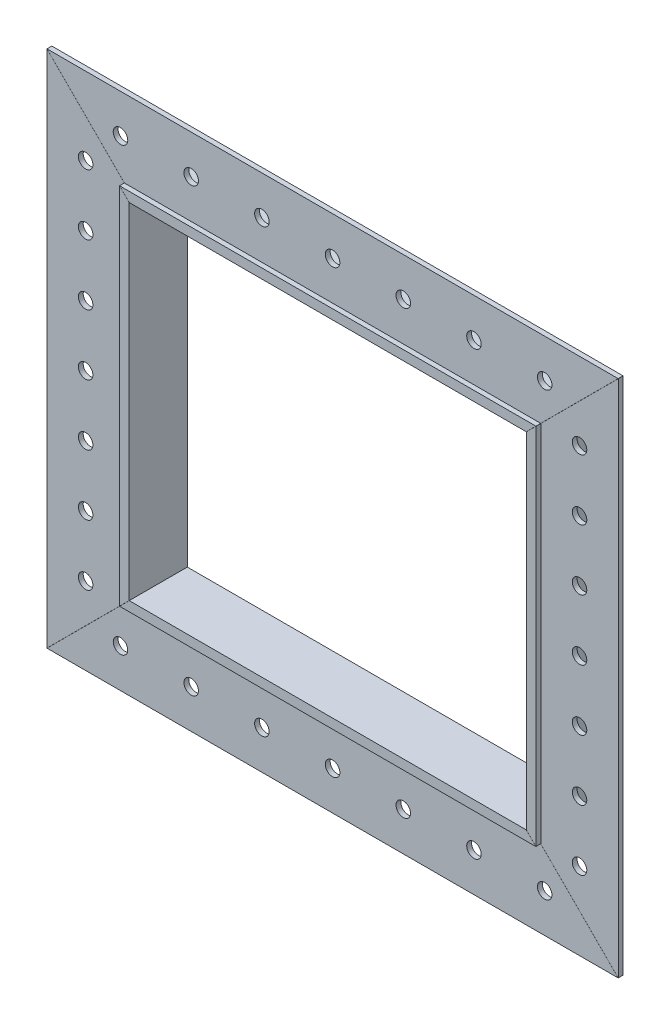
ISO-10303-21;
HEADER;
FILE_DESCRIPTION(('STEP AP214'),'2;1');
FILE_NAME('part.step','',(''),(''),'','','');
FILE_SCHEMA(('AUTOMOTIVE_DESIGN { 1 0 10303 214 1 1 1 1 }'));
ENDSEC;
DATA;
#1=APPLICATION_CONTEXT('core data for automotive mechanical design processes');
#2=APPLICATION_PROTOCOL_DEFINITION('international standard','automotive_design',2000,#1);
#3=PRODUCT_CONTEXT('',#1,'mechanical');
#4=PRODUCT('Part','Part','',(#3));
#5=PRODUCT_RELATED_PRODUCT_CATEGORY('part','',(#4));
#6=PRODUCT_DEFINITION_FORMATION('','',#4);
#7=PRODUCT_DEFINITION_CONTEXT('part definition',#1,'design');
#8=PRODUCT_DEFINITION('design','',#6,#7);
#9=PRODUCT_DEFINITION_SHAPE('','',#8);
#10=(LENGTH_UNIT() NAMED_UNIT(*) SI_UNIT(.MILLI.,.METRE.));
#11=(NAMED_UNIT(*) PLANE_ANGLE_UNIT() SI_UNIT($,.RADIAN.));
#12=(NAMED_UNIT(*) SI_UNIT($,.STERADIAN.) SOLID_ANGLE_UNIT());
#13=UNCERTAINTY_MEASURE_WITH_UNIT(LENGTH_MEASURE(1.E-05),#10,'distance_accuracy_value','');
#14=(GEOMETRIC_REPRESENTATION_CONTEXT(3) GLOBAL_UNCERTAINTY_ASSIGNED_CONTEXT((#13)) GLOBAL_UNIT_ASSIGNED_CONTEXT((#10,
#11,#12)) REPRESENTATION_CONTEXT('',''));
#15=CARTESIAN_POINT('',(0.,0.,0.));
#16=DIRECTION('',(0.,0.,1.));
#17=DIRECTION('',(1.,0.,0.));
#18=AXIS2_PLACEMENT_3D('',#15,#16,#17);
#19=CARTESIAN_POINT('',(68.2625,59.69,9.525));
#20=DIRECTION('',(-1.,0.,0.));
#21=DIRECTION('',(0.,0.,1.));
#22=AXIS2_PLACEMENT_3D('',#19,#20,#21);
#23=PLANE('',#22);
#24=DIRECTION('',(0.,1.,0.));
#25=VECTOR('',#24,1.);
#26=CARTESIAN_POINT('',(68.2625,59.69,-9.525));
#27=LINE('',#26,#25);
#28=CARTESIAN_POINT('',(68.2625,-59.6720394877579,-9.525));
#29=VERTEX_POINT('',#28);
#30=CARTESIAN_POINT('',(68.2625,59.6720394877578,-9.525));
#31=VERTEX_POINT('',#30);
#32=EDGE_CURVE('E162',#29,#31,#27,.T.);
#33=ORIENTED_EDGE('',*,*,#32,.T.);
#34=DIRECTION('',(0.,0.,1.));
#35=VECTOR('',#34,1.);
#36=CARTESIAN_POINT('',(68.2625,59.6720394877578,9.525));
#37=LINE('',#36,#35);
#38=CARTESIAN_POINT('',(68.2625,59.6720394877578,6.35));
#39=VERTEX_POINT('',#38);
#40=EDGE_CURVE('E63',#31,#39,#37,.T.);
#41=ORIENTED_EDGE('',*,*,#40,.T.);
#42=DIRECTION('',(0.,1.,0.));
#43=VECTOR('',#42,1.);
#44=CARTESIAN_POINT('',(68.2625,-59.69,6.35));
#45=LINE('',#44,#43);
#46=CARTESIAN_POINT('',(68.2625,-59.6720394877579,6.35));
#47=VERTEX_POINT('',#46);
#48=EDGE_CURVE('E154',#47,#39,#45,.T.);
#49=ORIENTED_EDGE('',*,*,#48,.F.);
#50=DIRECTION('',(0.,0.,1.));
#51=VECTOR('',#50,1.);
#52=CARTESIAN_POINT('',(68.2625,-59.6720394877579,9.525));
#53=LINE('',#52,#51);
#54=EDGE_CURVE('E165',#29,#47,#53,.T.);
#55=ORIENTED_EDGE('',*,*,#54,.F.);
#56=EDGE_LOOP('',(#33,#41,#49,#55));
#57=FACE_BOUND('',#56,.T.);
#58=ADVANCED_FACE('F44',(#57),#23,.F.);
#59=CARTESIAN_POINT('',(0.,0.,9.525));
#60=DIRECTION('',(0.,0.,1.));
#61=DIRECTION('',(1.,0.,0.));
#62=AXIS2_PLACEMENT_3D('',#59,#60,#61);
#63=PLANE('',#62);
#64=DIRECTION('',(0.707106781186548,0.707106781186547,0.));
#65=VECTOR('',#64,1.);
#66=CARTESIAN_POINT('',(68.2714802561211,59.6810197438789,9.525));
#67=LINE('',#66,#65);
#68=CARTESIAN_POINT('',(65.096480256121,56.5060197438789,9.525));
#69=VERTEX_POINT('',#68);
#70=CARTESIAN_POINT('',(68.2625,59.6720394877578,9.525));
#71=VERTEX_POINT('',#70);
#72=EDGE_CURVE('E131',#69,#71,#67,.T.);
#73=ORIENTED_EDGE('',*,*,#72,.F.);
#74=DIRECTION('',(-0.707106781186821,0.707106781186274,0.));
#75=VECTOR('',#74,1.);
#76=CARTESIAN_POINT('',(65.096480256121,56.5060197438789,9.525));
#77=LINE('',#76,#75);
#78=CARTESIAN_POINT('',(65.0875,56.515,9.525));
#79=VERTEX_POINT('',#78);
#80=EDGE_CURVE('E48',#69,#79,#77,.T.);
#81=ORIENTED_EDGE('',*,*,#80,.T.);
#82=DIRECTION('',(0.,1.,0.));
#83=VECTOR('',#82,1.);
#84=CARTESIAN_POINT('',(65.0875,56.515,9.525));
#85=LINE('',#84,#83);
#86=CARTESIAN_POINT('',(65.0875,-56.515,9.525));
#87=VERTEX_POINT('',#86);
#88=EDGE_CURVE('E144',#87,#79,#85,.T.);
#89=ORIENTED_EDGE('',*,*,#88,.F.);
#90=DIRECTION('',(0.707106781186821,0.707106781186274,0.));
#91=VECTOR('',#90,1.);
#92=CARTESIAN_POINT('',(65.0785197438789,-56.5239802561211,9.525));
#93=LINE('',#92,#91);
#94=CARTESIAN_POINT('',(65.096480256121,-56.5060197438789,9.525));
#95=VERTEX_POINT('',#94);
#96=EDGE_CURVE('E186',#87,#95,#93,.T.);
#97=ORIENTED_EDGE('',*,*,#96,.T.);
#98=DIRECTION('',(0.707106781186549,-0.707106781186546,0.));
#99=VECTOR('',#98,1.);
#100=CARTESIAN_POINT('',(68.2714802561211,-59.6810197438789,9.525));
#101=LINE('',#100,#99);
#102=CARTESIAN_POINT('',(68.2625,-59.6720394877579,9.525));
#103=VERTEX_POINT('',#102);
#104=EDGE_CURVE('E183',#95,#103,#101,.T.);
#105=ORIENTED_EDGE('',*,*,#104,.T.);
#106=DIRECTION('',(0.,1.,0.));
#107=VECTOR('',#106,1.);
#108=CARTESIAN_POINT('',(68.2625,59.69,9.525));
#109=LINE('',#108,#107);
#110=EDGE_CURVE('E178',#103,#71,#109,.T.);
#111=ORIENTED_EDGE('',*,*,#110,.T.);
#112=EDGE_LOOP('',(#73,#81,#89,#97,#105,#111));
#113=FACE_BOUND('',#112,.T.);
#114=ADVANCED_FACE('F286',(#113),#63,.T.);
#115=CARTESIAN_POINT('',(0.,0.,-9.525));
#116=DIRECTION('',(0.,0.,1.));
#117=DIRECTION('',(1.,0.,0.));
#118=AXIS2_PLACEMENT_3D('',#115,#116,#117);
#119=PLANE('',#118);
#120=DIRECTION('',(-0.707106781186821,0.707106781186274,0.));
#121=VECTOR('',#120,1.);
#122=CARTESIAN_POINT('',(65.096480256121,56.5060197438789,-9.525));
#123=LINE('',#122,#121);
#124=CARTESIAN_POINT('',(65.096480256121,56.5060197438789,-9.525));
#125=VERTEX_POINT('',#124);
#126=CARTESIAN_POINT('',(65.0875,56.515,-9.525));
#127=VERTEX_POINT('',#126);
#128=EDGE_CURVE('E175',#125,#127,#123,.T.);
#129=ORIENTED_EDGE('',*,*,#128,.F.);
#130=DIRECTION('',(0.707106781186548,0.707106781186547,0.));
#131=VECTOR('',#130,1.);
#132=CARTESIAN_POINT('',(68.2714802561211,59.6810197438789,-9.525));
#133=LINE('',#132,#131);
#134=EDGE_CURVE('E176',#125,#31,#133,.T.);
#135=ORIENTED_EDGE('',*,*,#134,.T.);
#136=ORIENTED_EDGE('',*,*,#32,.F.);
#137=DIRECTION('',(0.707106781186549,-0.707106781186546,0.));
#138=VECTOR('',#137,1.);
#139=CARTESIAN_POINT('',(68.2714802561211,-59.6810197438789,-9.525));
#140=LINE('',#139,#138);
#141=CARTESIAN_POINT('',(65.096480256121,-56.5060197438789,-9.525));
#142=VERTEX_POINT('',#141);
#143=EDGE_CURVE('E171',#142,#29,#140,.T.);
#144=ORIENTED_EDGE('',*,*,#143,.F.);
#145=DIRECTION('',(0.707106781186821,0.707106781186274,0.));
#146=VECTOR('',#145,1.);
#147=CARTESIAN_POINT('',(65.0785197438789,-56.5239802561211,-9.525));
#148=LINE('',#147,#146);
#149=CARTESIAN_POINT('',(65.0875,-56.515,-9.525));
#150=VERTEX_POINT('',#149);
#151=EDGE_CURVE('E103',#150,#142,#148,.T.);
#152=ORIENTED_EDGE('',*,*,#151,.F.);
#153=DIRECTION('',(0.,1.,0.));
#154=VECTOR('',#153,1.);
#155=CARTESIAN_POINT('',(65.0875,56.515,-9.525));
#156=LINE('',#155,#154);
#157=EDGE_CURVE('E158',#150,#127,#156,.T.);
#158=ORIENTED_EDGE('',*,*,#157,.T.);
#159=EDGE_LOOP('',(#129,#135,#136,#144,#152,#158));
#160=FACE_BOUND('',#159,.T.);
#161=ADVANCED_FACE('F203',(#160),#119,.F.);
#162=DIRECTION('',(0.,1.,0.));
#163=VECTOR('',#162,1.);
#164=CARTESIAN_POINT('',(68.2625,-59.69,7.9375));
#165=LINE('',#164,#163);
#166=CARTESIAN_POINT('',(68.2625,-59.6720394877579,7.9375));
#167=VERTEX_POINT('',#166);
#168=CARTESIAN_POINT('',(68.2625,59.6720394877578,7.9375));
#169=VERTEX_POINT('',#168);
#170=EDGE_CURVE('E156',#167,#169,#165,.T.);
#171=ORIENTED_EDGE('',*,*,#170,.T.);
#172=DIRECTION('',(0.,0.,1.));
#173=VECTOR('',#172,1.);
#174=CARTESIAN_POINT('',(68.2625,59.6720394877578,9.525));
#175=LINE('',#174,#173);
#176=EDGE_CURVE('E126',#169,#71,#175,.T.);
#177=ORIENTED_EDGE('',*,*,#176,.T.);
#178=ORIENTED_EDGE('',*,*,#110,.F.);
#179=DIRECTION('',(0.,0.,1.));
#180=VECTOR('',#179,1.);
#181=CARTESIAN_POINT('',(68.2625,-59.6720394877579,9.525));
#182=LINE('',#181,#180);
#183=EDGE_CURVE('E169',#167,#103,#182,.T.);
#184=ORIENTED_EDGE('',*,*,#183,.F.);
#185=EDGE_LOOP('',(#171,#177,#178,#184));
#186=FACE_BOUND('',#185,.T.);
#187=ADVANCED_FACE('F288',(#186),#23,.F.);
#188=CARTESIAN_POINT('',(93.6625,85.09,6.35));
#189=DIRECTION('',(1.,0.,0.));
#190=DIRECTION('',(0.,0.,-1.));
#191=AXIS2_PLACEMENT_3D('',#188,#189,#190);
#192=PLANE('',#191);
#193=DIRECTION('',(0.,0.,-1.));
#194=VECTOR('',#193,1.);
#195=CARTESIAN_POINT('',(93.6625,85.0720394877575,6.35));
#196=LINE('',#195,#194);
#197=CARTESIAN_POINT('',(93.6625,85.0720394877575,7.9375));
#198=VERTEX_POINT('',#197);
#199=CARTESIAN_POINT('',(93.6625,85.0720394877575,6.35));
#200=VERTEX_POINT('',#199);
#201=EDGE_CURVE('E12',#198,#200,#196,.T.);
#202=ORIENTED_EDGE('',*,*,#201,.F.);
#203=DIRECTION('',(0.,1.,0.));
#204=VECTOR('',#203,1.);
#205=CARTESIAN_POINT('',(93.6625,85.09,7.9375));
#206=LINE('',#205,#204);
#207=CARTESIAN_POINT('',(93.6625,-85.0720394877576,7.9375));
#208=VERTEX_POINT('',#207);
#209=EDGE_CURVE('E138',#208,#198,#206,.T.);
#210=ORIENTED_EDGE('',*,*,#209,.F.);
#211=DIRECTION('',(0.,0.,-1.));
#212=VECTOR('',#211,1.);
#213=CARTESIAN_POINT('',(93.6625,-85.0720394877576,6.35));
#214=LINE('',#213,#212);
#215=CARTESIAN_POINT('',(93.6625,-85.0720394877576,6.35));
#216=VERTEX_POINT('',#215);
#217=EDGE_CURVE('E155',#208,#216,#214,.T.);
#218=ORIENTED_EDGE('',*,*,#217,.T.);
#219=DIRECTION('',(0.,1.,0.));
#220=VECTOR('',#219,1.);
#221=CARTESIAN_POINT('',(93.6625,85.09,6.35));
#222=LINE('',#221,#220);
#223=EDGE_CURVE('E140',#216,#200,#222,.T.);
#224=ORIENTED_EDGE('',*,*,#223,.T.);
#225=EDGE_LOOP('',(#202,#210,#218,#224));
#226=FACE_BOUND('',#225,.T.);
#227=ADVANCED_FACE('F136',(#226),#192,.T.);
#228=CARTESIAN_POINT('',(0.,0.,6.35));
#229=DIRECTION('',(0.,0.,1.));
#230=DIRECTION('',(1.,0.,0.));
#231=AXIS2_PLACEMENT_3D('',#228,#229,#230);
#232=PLANE('',#231);
#233=CARTESIAN_POINT('',(80.9625,59.69,6.35));
#234=DIRECTION('',(0.,0.,1.));
#235=DIRECTION('',(1.,0.,0.));
#236=AXIS2_PLACEMENT_3D('',#233,#234,#235);
#237=CIRCLE('',#236,2.38125);
#238=CARTESIAN_POINT('',(83.34375,59.69,6.35));
#239=VERTEX_POINT('',#238);
#240=EDGE_CURVE('E209',#239,#239,#237,.F.);
#241=ORIENTED_EDGE('',*,*,#240,.F.);
#242=EDGE_LOOP('',(#241));
#243=FACE_BOUND('',#242,.T.);
#244=CARTESIAN_POINT('',(80.9625000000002,39.7933333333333,6.35));
#245=DIRECTION('',(0.,0.,1.));
#246=DIRECTION('',(1.,0.,0.));
#247=AXIS2_PLACEMENT_3D('',#244,#245,#246);
#248=CIRCLE('',#247,2.38125);
#249=CARTESIAN_POINT('',(83.3437500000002,39.7933333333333,6.35));
#250=VERTEX_POINT('',#249);
#251=EDGE_CURVE('E242',#250,#250,#248,.F.);
#252=ORIENTED_EDGE('',*,*,#251,.F.);
#253=EDGE_LOOP('',(#252));
#254=FACE_BOUND('',#253,.T.);
#255=CARTESIAN_POINT('',(80.9625000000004,19.8966666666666,6.35));
#256=DIRECTION('',(0.,0.,1.));
#257=DIRECTION('',(1.,0.,0.));
#258=AXIS2_PLACEMENT_3D('',#255,#256,#257);
#259=CIRCLE('',#258,2.38125000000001);
#260=CARTESIAN_POINT('',(83.3437500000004,19.8966666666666,6.35));
#261=VERTEX_POINT('',#260);
#262=EDGE_CURVE('E236',#261,#261,#259,.F.);
#263=ORIENTED_EDGE('',*,*,#262,.F.);
#264=EDGE_LOOP('',(#263));
#265=FACE_BOUND('',#264,.T.);
#266=CARTESIAN_POINT('',(80.9625000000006,0.,6.35));
#267=DIRECTION('',(0.,0.,1.));
#268=DIRECTION('',(1.,0.,0.));
#269=AXIS2_PLACEMENT_3D('',#266,#267,#268);
#270=CIRCLE('',#269,2.38125000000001);
#271=CARTESIAN_POINT('',(83.3437500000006,0.,6.35));
#272=VERTEX_POINT('',#271);
#273=EDGE_CURVE('E230',#272,#272,#270,.F.);
#274=ORIENTED_EDGE('',*,*,#273,.F.);
#275=EDGE_LOOP('',(#274));
#276=FACE_BOUND('',#275,.T.);
#277=CARTESIAN_POINT('',(80.9625000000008,-19.8966666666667,6.35));
#278=DIRECTION('',(0.,0.,1.));
#279=DIRECTION('',(1.,0.,0.));
#280=AXIS2_PLACEMENT_3D('',#277,#278,#279);
#281=CIRCLE('',#280,2.38125000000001);
#282=CARTESIAN_POINT('',(83.3437500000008,-19.8966666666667,6.35));
#283=VERTEX_POINT('',#282);
#284=EDGE_CURVE('E224',#283,#283,#281,.F.);
#285=ORIENTED_EDGE('',*,*,#284,.F.);
#286=EDGE_LOOP('',(#285));
#287=FACE_BOUND('',#286,.T.);
#288=CARTESIAN_POINT('',(80.962500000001,-39.7933333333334,6.35));
#289=DIRECTION('',(0.,0.,1.));
#290=DIRECTION('',(1.,0.,0.));
#291=AXIS2_PLACEMENT_3D('',#288,#289,#290);
#292=CIRCLE('',#291,2.38125);
#293=CARTESIAN_POINT('',(83.3437500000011,-39.7933333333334,6.35));
#294=VERTEX_POINT('',#293);
#295=EDGE_CURVE('E218',#294,#294,#292,.F.);
#296=ORIENTED_EDGE('',*,*,#295,.F.);
#297=EDGE_LOOP('',(#296));
#298=FACE_BOUND('',#297,.T.);
#299=CARTESIAN_POINT('',(80.9625,-59.6900000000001,6.35));
#300=DIRECTION('',(0.,0.,1.));
#301=DIRECTION('',(1.,0.,0.));
#302=AXIS2_PLACEMENT_3D('',#299,#300,#301);
#303=CIRCLE('',#302,2.38125);
#304=CARTESIAN_POINT('',(83.34375,-59.6900000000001,6.35));
#305=VERTEX_POINT('',#304);
#306=EDGE_CURVE('E211',#305,#305,#303,.F.);
#307=ORIENTED_EDGE('',*,*,#306,.F.);
#308=EDGE_LOOP('',(#307));
#309=FACE_BOUND('',#308,.T.);
#310=ORIENTED_EDGE('',*,*,#48,.T.);
#311=DIRECTION('',(0.707106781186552,0.707106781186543,0.));
#312=VECTOR('',#311,1.);
#313=CARTESIAN_POINT('',(4.29523025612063,-4.29523025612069,6.35));
#314=LINE('',#313,#312);
#315=EDGE_CURVE('E149',#39,#200,#314,.T.);
#316=ORIENTED_EDGE('',*,*,#315,.T.);
#317=ORIENTED_EDGE('',*,*,#223,.F.);
#318=DIRECTION('',(0.707106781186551,-0.707106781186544,0.));
#319=VECTOR('',#318,1.);
#320=CARTESIAN_POINT('',(4.2952302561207,4.29523025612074,6.35));
#321=LINE('',#320,#319);
#322=EDGE_CURVE('E167',#47,#216,#321,.T.);
#323=ORIENTED_EDGE('',*,*,#322,.F.);
#324=EDGE_LOOP('',(#310,#316,#317,#323));
#325=FACE_BOUND('',#324,.T.);
#326=ADVANCED_FACE('F257',(#243,#254,#265,#276,#287,#298,#309,#325),#232,.F.);
#327=CARTESIAN_POINT('',(0.,0.,7.9375));
#328=DIRECTION('',(0.,0.,1.));
#329=DIRECTION('',(1.,0.,0.));
#330=AXIS2_PLACEMENT_3D('',#327,#328,#329);
#331=PLANE('',#330);
#332=CARTESIAN_POINT('',(80.9625,59.69,7.9375));
#333=DIRECTION('',(0.,0.,1.));
#334=DIRECTION('',(1.,0.,0.));
#335=AXIS2_PLACEMENT_3D('',#332,#333,#334);
#336=CIRCLE('',#335,2.38125);
#337=CARTESIAN_POINT('',(83.34375,59.69,7.9375));
#338=VERTEX_POINT('',#337);
#339=EDGE_CURVE('E245',#338,#338,#336,.T.);
#340=ORIENTED_EDGE('',*,*,#339,.F.);
#341=EDGE_LOOP('',(#340));
#342=FACE_BOUND('',#341,.T.);
#343=CARTESIAN_POINT('',(80.9625000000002,39.7933333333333,7.9375));
#344=DIRECTION('',(0.,0.,1.));
#345=DIRECTION('',(1.,0.,0.));
#346=AXIS2_PLACEMENT_3D('',#343,#344,#345);
#347=CIRCLE('',#346,2.38125);
#348=CARTESIAN_POINT('',(83.3437500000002,39.7933333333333,7.9375));
#349=VERTEX_POINT('',#348);
#350=EDGE_CURVE('E239',#349,#349,#347,.T.);
#351=ORIENTED_EDGE('',*,*,#350,.F.);
#352=EDGE_LOOP('',(#351));
#353=FACE_BOUND('',#352,.T.);
#354=CARTESIAN_POINT('',(80.9625000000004,19.8966666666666,7.9375));
#355=DIRECTION('',(0.,0.,1.));
#356=DIRECTION('',(1.,0.,0.));
#357=AXIS2_PLACEMENT_3D('',#354,#355,#356);
#358=CIRCLE('',#357,2.38125000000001);
#359=CARTESIAN_POINT('',(83.3437500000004,19.8966666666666,7.9375));
#360=VERTEX_POINT('',#359);
#361=EDGE_CURVE('E233',#360,#360,#358,.T.);
#362=ORIENTED_EDGE('',*,*,#361,.F.);
#363=EDGE_LOOP('',(#362));
#364=FACE_BOUND('',#363,.T.);
#365=CARTESIAN_POINT('',(80.9625000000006,0.,7.9375));
#366=DIRECTION('',(0.,0.,1.));
#367=DIRECTION('',(1.,0.,0.));
#368=AXIS2_PLACEMENT_3D('',#365,#366,#367);
#369=CIRCLE('',#368,2.38125000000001);
#370=CARTESIAN_POINT('',(83.3437500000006,0.,7.9375));
#371=VERTEX_POINT('',#370);
#372=EDGE_CURVE('E227',#371,#371,#369,.T.);
#373=ORIENTED_EDGE('',*,*,#372,.F.);
#374=EDGE_LOOP('',(#373));
#375=FACE_BOUND('',#374,.T.);
#376=CARTESIAN_POINT('',(80.9625000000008,-19.8966666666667,7.9375));
#377=DIRECTION('',(0.,0.,1.));
#378=DIRECTION('',(1.,0.,0.));
#379=AXIS2_PLACEMENT_3D('',#376,#377,#378);
#380=CIRCLE('',#379,2.38125000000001);
#381=CARTESIAN_POINT('',(83.3437500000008,-19.8966666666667,7.9375));
#382=VERTEX_POINT('',#381);
#383=EDGE_CURVE('E221',#382,#382,#380,.T.);
#384=ORIENTED_EDGE('',*,*,#383,.F.);
#385=EDGE_LOOP('',(#384));
#386=FACE_BOUND('',#385,.T.);
#387=CARTESIAN_POINT('',(80.962500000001,-39.7933333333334,7.9375));
#388=DIRECTION('',(0.,0.,1.));
#389=DIRECTION('',(1.,0.,0.));
#390=AXIS2_PLACEMENT_3D('',#387,#388,#389);
#391=CIRCLE('',#390,2.38125);
#392=CARTESIAN_POINT('',(83.3437500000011,-39.7933333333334,7.9375));
#393=VERTEX_POINT('',#392);
#394=EDGE_CURVE('E214',#393,#393,#391,.T.);
#395=ORIENTED_EDGE('',*,*,#394,.F.);
#396=EDGE_LOOP('',(#395));
#397=FACE_BOUND('',#396,.T.);
#398=CARTESIAN_POINT('',(80.9625,-59.6900000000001,7.9375));
#399=DIRECTION('',(0.,0.,1.));
#400=DIRECTION('',(1.,0.,0.));
#401=AXIS2_PLACEMENT_3D('',#398,#399,#400);
#402=CIRCLE('',#401,2.38125);
#403=CARTESIAN_POINT('',(83.34375,-59.6900000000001,7.9375));
#404=VERTEX_POINT('',#403);
#405=EDGE_CURVE('E215',#404,#404,#402,.T.);
#406=ORIENTED_EDGE('',*,*,#405,.F.);
#407=EDGE_LOOP('',(#406));
#408=FACE_BOUND('',#407,.T.);
#409=DIRECTION('',(0.707106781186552,0.707106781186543,0.));
#410=VECTOR('',#409,1.);
#411=CARTESIAN_POINT('',(4.29523025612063,-4.29523025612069,7.9375));
#412=LINE('',#411,#410);
#413=EDGE_CURVE('E54',#169,#198,#412,.T.);
#414=ORIENTED_EDGE('',*,*,#413,.F.);
#415=ORIENTED_EDGE('',*,*,#170,.F.);
#416=DIRECTION('',(0.707106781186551,-0.707106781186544,0.));
#417=VECTOR('',#416,1.);
#418=CARTESIAN_POINT('',(4.2952302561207,4.29523025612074,7.9375));
#419=LINE('',#418,#417);
#420=EDGE_CURVE('E143',#167,#208,#419,.T.);
#421=ORIENTED_EDGE('',*,*,#420,.T.);
#422=ORIENTED_EDGE('',*,*,#209,.T.);
#423=EDGE_LOOP('',(#414,#415,#421,#422));
#424=FACE_BOUND('',#423,.T.);
#425=ADVANCED_FACE('F142',(#342,#353,#364,#375,#386,#397,#408,#424),#331,.T.);
#426=CARTESIAN_POINT('',(65.0875,56.515,9.525));
#427=DIRECTION('',(-1.,0.,0.));
#428=DIRECTION('',(0.,0.,1.));
#429=AXIS2_PLACEMENT_3D('',#426,#427,#428);
#430=PLANE('',#429);
#431=ORIENTED_EDGE('',*,*,#157,.F.);
#432=DIRECTION('',(0.,0.,-1.));
#433=VECTOR('',#432,1.);
#434=CARTESIAN_POINT('',(65.0875,-56.515,9.525));
#435=LINE('',#434,#433);
#436=EDGE_CURVE('E109',#87,#150,#435,.T.);
#437=ORIENTED_EDGE('',*,*,#436,.F.);
#438=ORIENTED_EDGE('',*,*,#88,.T.);
#439=DIRECTION('',(0.,0.,-1.));
#440=VECTOR('',#439,1.);
#441=CARTESIAN_POINT('',(65.0875,56.515,9.525));
#442=LINE('',#441,#440);
#443=EDGE_CURVE('E147',#79,#127,#442,.T.);
#444=ORIENTED_EDGE('',*,*,#443,.T.);
#445=EDGE_LOOP('',(#431,#437,#438,#444));
#446=FACE_BOUND('',#445,.T.);
#447=ADVANCED_FACE('F200',(#446),#430,.T.);
#448=CARTESIAN_POINT('',(65.096480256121,-56.5060197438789,-9.525));
#449=DIRECTION('',(-0.707106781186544,-0.707106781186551,0.));
#450=DIRECTION('',(0.707106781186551,-0.707106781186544,0.));
#451=AXIS2_PLACEMENT_3D('',#448,#449,#450);
#452=PLANE('',#451);
#453=ORIENTED_EDGE('',*,*,#54,.T.);
#454=ORIENTED_EDGE('',*,*,#322,.T.);
#455=ORIENTED_EDGE('',*,*,#217,.F.);
#456=ORIENTED_EDGE('',*,*,#420,.F.);
#457=ORIENTED_EDGE('',*,*,#183,.T.);
#458=ORIENTED_EDGE('',*,*,#104,.F.);
#459=DIRECTION('',(0.,0.,1.));
#460=VECTOR('',#459,1.);
#461=CARTESIAN_POINT('',(65.096480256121,-56.5060197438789,-9.525));
#462=LINE('',#461,#460);
#463=EDGE_CURVE('E180',#142,#95,#462,.T.);
#464=ORIENTED_EDGE('',*,*,#463,.F.);
#465=ORIENTED_EDGE('',*,*,#143,.T.);
#466=EDGE_LOOP('',(#453,#454,#455,#456,#457,#458,#464,#465));
#467=FACE_BOUND('',#466,.T.);
#468=ADVANCED_FACE('F306',(#467),#452,.T.);
#469=CARTESIAN_POINT('',(65.0785197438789,-56.5239802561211,-9.525));
#470=DIRECTION('',(0.707106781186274,-0.707106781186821,0.));
#471=DIRECTION('',(0.707106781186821,0.707106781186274,0.));
#472=AXIS2_PLACEMENT_3D('',#469,#470,#471);
#473=PLANE('',#472);
#474=ORIENTED_EDGE('',*,*,#436,.T.);
#475=ORIENTED_EDGE('',*,*,#151,.T.);
#476=ORIENTED_EDGE('',*,*,#463,.T.);
#477=ORIENTED_EDGE('',*,*,#96,.F.);
#478=EDGE_LOOP('',(#474,#475,#476,#477));
#479=FACE_BOUND('',#478,.T.);
#480=ADVANCED_FACE('F308',(#479),#473,.T.);
#481=CARTESIAN_POINT('',(65.096480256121,56.5060197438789,-9.525));
#482=DIRECTION('',(0.707106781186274,0.707106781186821,0.));
#483=DIRECTION('',(-0.707106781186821,0.707106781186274,0.));
#484=AXIS2_PLACEMENT_3D('',#481,#482,#483);
#485=PLANE('',#484);
#486=ORIENTED_EDGE('',*,*,#443,.F.);
#487=ORIENTED_EDGE('',*,*,#80,.F.);
#488=DIRECTION('',(0.,0.,1.));
#489=VECTOR('',#488,1.);
#490=CARTESIAN_POINT('',(65.096480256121,56.5060197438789,-9.525));
#491=LINE('',#490,#489);
#492=EDGE_CURVE('E173',#125,#69,#491,.T.);
#493=ORIENTED_EDGE('',*,*,#492,.F.);
#494=ORIENTED_EDGE('',*,*,#128,.T.);
#495=EDGE_LOOP('',(#486,#487,#493,#494));
#496=FACE_BOUND('',#495,.T.);
#497=ADVANCED_FACE('F46',(#496),#485,.T.);
#498=CARTESIAN_POINT('',(65.096480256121,56.5060197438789,-9.525));
#499=DIRECTION('',(0.707106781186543,-0.707106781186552,0.));
#500=DIRECTION('',(0.707106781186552,0.707106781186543,0.));
#501=AXIS2_PLACEMENT_3D('',#498,#499,#500);
#502=PLANE('',#501);
#503=ORIENTED_EDGE('',*,*,#134,.F.);
#504=ORIENTED_EDGE('',*,*,#492,.T.);
#505=ORIENTED_EDGE('',*,*,#72,.T.);
#506=ORIENTED_EDGE('',*,*,#176,.F.);
#507=ORIENTED_EDGE('',*,*,#413,.T.);
#508=ORIENTED_EDGE('',*,*,#201,.T.);
#509=ORIENTED_EDGE('',*,*,#315,.F.);
#510=ORIENTED_EDGE('',*,*,#40,.F.);
#511=EDGE_LOOP('',(#503,#504,#505,#506,#507,#508,#509,#510));
#512=FACE_BOUND('',#511,.T.);
#513=ADVANCED_FACE('F124',(#512),#502,.F.);
#514=CARTESIAN_POINT('',(80.9625,-59.6900000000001,-0.385192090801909));
#515=DIRECTION('',(0.,0.,1.));
#516=DIRECTION('',(1.,0.,0.));
#517=AXIS2_PLACEMENT_3D('',#514,#515,#516);
#518=CYLINDRICAL_SURFACE('',#517,2.38125);
#519=ORIENTED_EDGE('',*,*,#306,.T.);
#520=EDGE_LOOP('',(#519));
#521=FACE_BOUND('',#520,.T.);
#522=ORIENTED_EDGE('',*,*,#405,.T.);
#523=EDGE_LOOP('',(#522));
#524=FACE_BOUND('',#523,.T.);
#525=ADVANCED_FACE('F271',(#521,#524),#518,.F.);
#526=CARTESIAN_POINT('',(80.962500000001,-39.7933333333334,-0.385192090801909));
#527=DIRECTION('',(0.,0.,1.));
#528=DIRECTION('',(1.,0.,0.));
#529=AXIS2_PLACEMENT_3D('',#526,#527,#528);
#530=CYLINDRICAL_SURFACE('',#529,2.38125);
#531=ORIENTED_EDGE('',*,*,#295,.T.);
#532=EDGE_LOOP('',(#531));
#533=FACE_BOUND('',#532,.T.);
#534=ORIENTED_EDGE('',*,*,#394,.T.);
#535=EDGE_LOOP('',(#534));
#536=FACE_BOUND('',#535,.T.);
#537=ADVANCED_FACE('F273',(#533,#536),#530,.F.);
#538=CARTESIAN_POINT('',(80.9625000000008,-19.8966666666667,-0.385192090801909));
#539=DIRECTION('',(0.,0.,1.));
#540=DIRECTION('',(1.,0.,0.));
#541=AXIS2_PLACEMENT_3D('',#538,#539,#540);
#542=CYLINDRICAL_SURFACE('',#541,2.38125000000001);
#543=ORIENTED_EDGE('',*,*,#284,.T.);
#544=EDGE_LOOP('',(#543));
#545=FACE_BOUND('',#544,.T.);
#546=ORIENTED_EDGE('',*,*,#383,.T.);
#547=EDGE_LOOP('',(#546));
#548=FACE_BOUND('',#547,.T.);
#549=ADVANCED_FACE('F280',(#545,#548),#542,.F.);
#550=CARTESIAN_POINT('',(80.9625000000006,0.,-0.385192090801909));
#551=DIRECTION('',(0.,0.,1.));
#552=DIRECTION('',(1.,0.,0.));
#553=AXIS2_PLACEMENT_3D('',#550,#551,#552);
#554=CYLINDRICAL_SURFACE('',#553,2.38125000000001);
#555=ORIENTED_EDGE('',*,*,#273,.T.);
#556=EDGE_LOOP('',(#555));
#557=FACE_BOUND('',#556,.T.);
#558=ORIENTED_EDGE('',*,*,#372,.T.);
#559=EDGE_LOOP('',(#558));
#560=FACE_BOUND('',#559,.T.);
#561=ADVANCED_FACE('F377',(#557,#560),#554,.F.);
#562=CARTESIAN_POINT('',(80.9625000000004,19.8966666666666,-0.385192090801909));
#563=DIRECTION('',(0.,0.,1.));
#564=DIRECTION('',(1.,0.,0.));
#565=AXIS2_PLACEMENT_3D('',#562,#563,#564);
#566=CYLINDRICAL_SURFACE('',#565,2.38125000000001);
#567=ORIENTED_EDGE('',*,*,#262,.T.);
#568=EDGE_LOOP('',(#567));
#569=FACE_BOUND('',#568,.T.);
#570=ORIENTED_EDGE('',*,*,#361,.T.);
#571=EDGE_LOOP('',(#570));
#572=FACE_BOUND('',#571,.T.);
#573=ADVANCED_FACE('F387',(#569,#572),#566,.F.);
#574=CARTESIAN_POINT('',(80.9625000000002,39.7933333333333,-0.385192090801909));
#575=DIRECTION('',(0.,0.,1.));
#576=DIRECTION('',(1.,0.,0.));
#577=AXIS2_PLACEMENT_3D('',#574,#575,#576);
#578=CYLINDRICAL_SURFACE('',#577,2.38125);
#579=ORIENTED_EDGE('',*,*,#251,.T.);
#580=EDGE_LOOP('',(#579));
#581=FACE_BOUND('',#580,.T.);
#582=ORIENTED_EDGE('',*,*,#350,.T.);
#583=EDGE_LOOP('',(#582));
#584=FACE_BOUND('',#583,.T.);
#585=ADVANCED_FACE('F397',(#581,#584),#578,.F.);
#586=CARTESIAN_POINT('',(80.9625,59.69,-0.385192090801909));
#587=DIRECTION('',(0.,0.,1.));
#588=DIRECTION('',(1.,0.,0.));
#589=AXIS2_PLACEMENT_3D('',#586,#587,#588);
#590=CYLINDRICAL_SURFACE('',#589,2.38125);
#591=ORIENTED_EDGE('',*,*,#240,.T.);
#592=EDGE_LOOP('',(#591));
#593=FACE_BOUND('',#592,.T.);
#594=ORIENTED_EDGE('',*,*,#339,.T.);
#595=EDGE_LOOP('',(#594));
#596=FACE_BOUND('',#595,.T.);
#597=ADVANCED_FACE('F253',(#593,#596),#590,.F.);
#598=CLOSED_SHELL('',(#58,#114,#161,#187,#227,#326,#425,#447,#468,#480,#497,#513,#525,#537,#549,
#561,#573,#585,#597));
#599=MANIFOLD_SOLID_BREP('B2',#598);
#600=CARTESIAN_POINT('',(0.,0.,6.35));
#601=DIRECTION('',(0.,0.,1.));
#602=DIRECTION('',(1.,0.,0.));
#603=AXIS2_PLACEMENT_3D('',#600,#601,#602);
#604=PLANE('',#603);
#605=CARTESIAN_POINT('',(-69.5324999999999,72.39,6.35));
#606=DIRECTION('',(0.,0.,1.));
#607=DIRECTION('',(1.,0.,0.));
#608=AXIS2_PLACEMENT_3D('',#605,#606,#607);
#609=CIRCLE('',#608,2.38125000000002);
#610=CARTESIAN_POINT('',(-67.1512499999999,72.39,6.35));
#611=VERTEX_POINT('',#610);
#612=EDGE_CURVE('E608',#611,#611,#609,.F.);
#613=ORIENTED_EDGE('',*,*,#612,.F.);
#614=EDGE_LOOP('',(#613));
#615=FACE_BOUND('',#614,.T.);
#616=CARTESIAN_POINT('',(-46.3549999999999,72.39,6.35));
#617=DIRECTION('',(0.,0.,1.));
#618=DIRECTION('',(1.,0.,0.));
#619=AXIS2_PLACEMENT_3D('',#616,#617,#618);
#620=CIRCLE('',#619,2.38125);
#621=CARTESIAN_POINT('',(-43.9737499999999,72.39,6.35));
#622=VERTEX_POINT('',#621);
#623=EDGE_CURVE('E679',#622,#622,#620,.F.);
#624=ORIENTED_EDGE('',*,*,#623,.F.);
#625=EDGE_LOOP('',(#624));
#626=FACE_BOUND('',#625,.T.);
#627=CARTESIAN_POINT('',(-23.1774999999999,72.39,6.35));
#628=DIRECTION('',(0.,0.,1.));
#629=DIRECTION('',(1.,0.,0.));
#630=AXIS2_PLACEMENT_3D('',#627,#628,#629);
#631=CIRCLE('',#630,2.38125);
#632=CARTESIAN_POINT('',(-20.79625,72.39,6.35));
#633=VERTEX_POINT('',#632);
#634=EDGE_CURVE('E673',#633,#633,#631,.F.);
#635=ORIENTED_EDGE('',*,*,#634,.F.);
#636=EDGE_LOOP('',(#635));
#637=FACE_BOUND('',#636,.T.);
#638=CARTESIAN_POINT('',(0.,72.39,6.35));
#639=DIRECTION('',(0.,0.,1.));
#640=DIRECTION('',(1.,0.,0.));
#641=AXIS2_PLACEMENT_3D('',#638,#639,#640);
#642=CIRCLE('',#641,2.38125);
#643=CARTESIAN_POINT('',(2.38124999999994,72.39,6.35));
#644=VERTEX_POINT('',#643);
#645=EDGE_CURVE('E667',#644,#644,#642,.F.);
#646=ORIENTED_EDGE('',*,*,#645,.F.);
#647=EDGE_LOOP('',(#646));
#648=FACE_BOUND('',#647,.T.);
#649=CARTESIAN_POINT('',(23.1775,72.39,6.35));
#650=DIRECTION('',(0.,0.,1.));
#651=DIRECTION('',(1.,0.,0.));
#652=AXIS2_PLACEMENT_3D('',#649,#650,#651);
#653=CIRCLE('',#652,2.38125);
#654=CARTESIAN_POINT('',(25.55875,72.39,6.35));
#655=VERTEX_POINT('',#654);
#656=EDGE_CURVE('E661',#655,#655,#653,.F.);
#657=ORIENTED_EDGE('',*,*,#656,.F.);
#658=EDGE_LOOP('',(#657));
#659=FACE_BOUND('',#658,.T.);
#660=CARTESIAN_POINT('',(46.355,72.39,6.35));
#661=DIRECTION('',(0.,0.,1.));
#662=DIRECTION('',(1.,0.,0.));
#663=AXIS2_PLACEMENT_3D('',#660,#661,#662);
#664=CIRCLE('',#663,2.38125);
#665=CARTESIAN_POINT('',(48.73625,72.39,6.35));
#666=VERTEX_POINT('',#665);
#667=EDGE_CURVE('E655',#666,#666,#664,.F.);
#668=ORIENTED_EDGE('',*,*,#667,.F.);
#669=EDGE_LOOP('',(#668));
#670=FACE_BOUND('',#669,.T.);
#671=CARTESIAN_POINT('',(69.5325,72.39,6.35));
#672=DIRECTION('',(0.,0.,1.));
#673=DIRECTION('',(1.,0.,0.));
#674=AXIS2_PLACEMENT_3D('',#671,#672,#673);
#675=CIRCLE('',#674,2.38125);
#676=CARTESIAN_POINT('',(71.91375,72.39,6.35));
#677=VERTEX_POINT('',#676);
#678=EDGE_CURVE('E648',#677,#677,#675,.F.);
#679=ORIENTED_EDGE('',*,*,#678,.F.);
#680=EDGE_LOOP('',(#679));
#681=FACE_BOUND('',#680,.T.);
#682=DIRECTION('',(0.707106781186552,0.707106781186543,0.));
#683=VECTOR('',#682,1.);
#684=CARTESIAN_POINT('',(4.27726974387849,-4.27726974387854,6.35));
#685=LINE('',#684,#683);
#686=CARTESIAN_POINT('',(68.2445394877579,59.69,6.35));
#687=VERTEX_POINT('',#686);
#688=CARTESIAN_POINT('',(93.6445394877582,85.09,6.35));
#689=VERTEX_POINT('',#688);
#690=EDGE_CURVE('E611',#687,#689,#685,.T.);
#691=ORIENTED_EDGE('',*,*,#690,.F.);
#692=DIRECTION('',(-1.,0.,0.));
#693=VECTOR('',#692,1.);
#694=CARTESIAN_POINT('',(68.2625,59.69,6.35));
#695=LINE('',#694,#693);
#696=CARTESIAN_POINT('',(-68.2445394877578,59.69,6.35));
#697=VERTEX_POINT('',#696);
#698=EDGE_CURVE('E605',#687,#697,#695,.T.);
#699=ORIENTED_EDGE('',*,*,#698,.T.);
#700=DIRECTION('',(0.707106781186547,-0.707106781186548,0.));
#701=VECTOR('',#700,1.);
#702=CARTESIAN_POINT('',(-4.27726974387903,-4.27726974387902,6.35));
#703=LINE('',#702,#701);
#704=CARTESIAN_POINT('',(-93.6445394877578,85.09,6.35));
#705=VERTEX_POINT('',#704);
#706=EDGE_CURVE('E622',#705,#697,#703,.T.);
#707=ORIENTED_EDGE('',*,*,#706,.F.);
#708=DIRECTION('',(-1.,0.,0.));
#709=VECTOR('',#708,1.);
#710=CARTESIAN_POINT('',(-93.6624999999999,85.09,6.35));
#711=LINE('',#710,#709);
#712=EDGE_CURVE('E598',#689,#705,#711,.T.);
#713=ORIENTED_EDGE('',*,*,#712,.F.);
#714=EDGE_LOOP('',(#691,#699,#707,#713));
#715=FACE_BOUND('',#714,.T.);
#716=ADVANCED_FACE('F486',(#615,#626,#637,#648,#659,#670,#681,#715),#604,.F.);
#717=CARTESIAN_POINT('',(0.,0.,7.9375));
#718=DIRECTION('',(0.,0.,1.));
#719=DIRECTION('',(1.,0.,0.));
#720=AXIS2_PLACEMENT_3D('',#717,#718,#719);
#721=PLANE('',#720);
#722=CARTESIAN_POINT('',(-69.5324999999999,72.39,7.9375));
#723=DIRECTION('',(0.,0.,1.));
#724=DIRECTION('',(1.,0.,0.));
#725=AXIS2_PLACEMENT_3D('',#722,#723,#724);
#726=CIRCLE('',#725,2.38125000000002);
#727=CARTESIAN_POINT('',(-67.1512499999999,72.39,7.9375));
#728=VERTEX_POINT('',#727);
#729=EDGE_CURVE('E682',#728,#728,#726,.T.);
#730=ORIENTED_EDGE('',*,*,#729,.F.);
#731=EDGE_LOOP('',(#730));
#732=FACE_BOUND('',#731,.T.);
#733=CARTESIAN_POINT('',(-46.3549999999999,72.39,7.9375));
#734=DIRECTION('',(0.,0.,1.));
#735=DIRECTION('',(1.,0.,0.));
#736=AXIS2_PLACEMENT_3D('',#733,#734,#735);
#737=CIRCLE('',#736,2.38125);
#738=CARTESIAN_POINT('',(-43.9737499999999,72.39,7.9375));
#739=VERTEX_POINT('',#738);
#740=EDGE_CURVE('E676',#739,#739,#737,.T.);
#741=ORIENTED_EDGE('',*,*,#740,.F.);
#742=EDGE_LOOP('',(#741));
#743=FACE_BOUND('',#742,.T.);
#744=CARTESIAN_POINT('',(-23.1774999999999,72.39,7.9375));
#745=DIRECTION('',(0.,0.,1.));
#746=DIRECTION('',(1.,0.,0.));
#747=AXIS2_PLACEMENT_3D('',#744,#745,#746);
#748=CIRCLE('',#747,2.38125);
#749=CARTESIAN_POINT('',(-20.79625,72.39,7.9375));
#750=VERTEX_POINT('',#749);
#751=EDGE_CURVE('E670',#750,#750,#748,.T.);
#752=ORIENTED_EDGE('',*,*,#751,.F.);
#753=EDGE_LOOP('',(#752));
#754=FACE_BOUND('',#753,.T.);
#755=CARTESIAN_POINT('',(0.,72.39,7.9375));
#756=DIRECTION('',(0.,0.,1.));
#757=DIRECTION('',(1.,0.,0.));
#758=AXIS2_PLACEMENT_3D('',#755,#756,#757);
#759=CIRCLE('',#758,2.38125);
#760=CARTESIAN_POINT('',(2.38124999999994,72.39,7.9375));
#761=VERTEX_POINT('',#760);
#762=EDGE_CURVE('E664',#761,#761,#759,.T.);
#763=ORIENTED_EDGE('',*,*,#762,.F.);
#764=EDGE_LOOP('',(#763));
#765=FACE_BOUND('',#764,.T.);
#766=CARTESIAN_POINT('',(23.1775,72.39,7.9375));
#767=DIRECTION('',(0.,0.,1.));
#768=DIRECTION('',(1.,0.,0.));
#769=AXIS2_PLACEMENT_3D('',#766,#767,#768);
#770=CIRCLE('',#769,2.38125);
#771=CARTESIAN_POINT('',(25.55875,72.39,7.9375));
#772=VERTEX_POINT('',#771);
#773=EDGE_CURVE('E658',#772,#772,#770,.T.);
#774=ORIENTED_EDGE('',*,*,#773,.F.);
#775=EDGE_LOOP('',(#774));
#776=FACE_BOUND('',#775,.T.);
#777=CARTESIAN_POINT('',(46.355,72.39,7.9375));
#778=DIRECTION('',(0.,0.,1.));
#779=DIRECTION('',(1.,0.,0.));
#780=AXIS2_PLACEMENT_3D('',#777,#778,#779);
#781=CIRCLE('',#780,2.38125);
#782=CARTESIAN_POINT('',(48.73625,72.39,7.9375));
#783=VERTEX_POINT('',#782);
#784=EDGE_CURVE('E651',#783,#783,#781,.T.);
#785=ORIENTED_EDGE('',*,*,#784,.F.);
#786=EDGE_LOOP('',(#785));
#787=FACE_BOUND('',#786,.T.);
#788=CARTESIAN_POINT('',(69.5325,72.39,7.9375));
#789=DIRECTION('',(0.,0.,1.));
#790=DIRECTION('',(1.,0.,0.));
#791=AXIS2_PLACEMENT_3D('',#788,#789,#790);
#792=CIRCLE('',#791,2.38125);
#793=CARTESIAN_POINT('',(71.91375,72.39,7.9375));
#794=VERTEX_POINT('',#793);
#795=EDGE_CURVE('E652',#794,#794,#792,.T.);
#796=ORIENTED_EDGE('',*,*,#795,.F.);
#797=EDGE_LOOP('',(#796));
#798=FACE_BOUND('',#797,.T.);
#799=DIRECTION('',(-1.,0.,0.));
#800=VECTOR('',#799,1.);
#801=CARTESIAN_POINT('',(68.2625,59.69,7.9375));
#802=LINE('',#801,#800);
#803=CARTESIAN_POINT('',(68.2445394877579,59.69,7.9375));
#804=VERTEX_POINT('',#803);
#805=CARTESIAN_POINT('',(-68.2445394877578,59.69,7.9375));
#806=VERTEX_POINT('',#805);
#807=EDGE_CURVE('E592',#804,#806,#802,.T.);
#808=ORIENTED_EDGE('',*,*,#807,.F.);
#809=DIRECTION('',(0.707106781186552,0.707106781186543,0.));
#810=VECTOR('',#809,1.);
#811=CARTESIAN_POINT('',(4.27726974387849,-4.27726974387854,7.9375));
#812=LINE('',#811,#810);
#813=CARTESIAN_POINT('',(93.6445394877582,85.09,7.9375));
#814=VERTEX_POINT('',#813);
#815=EDGE_CURVE('E597',#804,#814,#812,.T.);
#816=ORIENTED_EDGE('',*,*,#815,.T.);
#817=DIRECTION('',(-1.,0.,0.));
#818=VECTOR('',#817,1.);
#819=CARTESIAN_POINT('',(-93.6624999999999,85.09,7.9375));
#820=LINE('',#819,#818);
#821=CARTESIAN_POINT('',(-93.6445394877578,85.09,7.9375));
#822=VERTEX_POINT('',#821);
#823=EDGE_CURVE('E593',#814,#822,#820,.T.);
#824=ORIENTED_EDGE('',*,*,#823,.T.);
#825=DIRECTION('',(0.707106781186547,-0.707106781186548,0.));
#826=VECTOR('',#825,1.);
#827=CARTESIAN_POINT('',(-4.27726974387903,-4.27726974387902,7.9375));
#828=LINE('',#827,#826);
#829=EDGE_CURVE('E596',#822,#806,#828,.T.);
#830=ORIENTED_EDGE('',*,*,#829,.T.);
#831=EDGE_LOOP('',(#808,#816,#824,#830));
#832=FACE_BOUND('',#831,.T.);
#833=ADVANCED_FACE('F692',(#732,#743,#754,#765,#776,#787,#798,#832),#721,.T.);
#834=CARTESIAN_POINT('',(-93.6624999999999,85.09,6.35));
#835=DIRECTION('',(0.,1.,0.));
#836=DIRECTION('',(0.,0.,1.));
#837=AXIS2_PLACEMENT_3D('',#834,#835,#836);
#838=PLANE('',#837);
#839=ORIENTED_EDGE('',*,*,#823,.F.);
#840=DIRECTION('',(0.,0.,-1.));
#841=VECTOR('',#840,1.);
#842=CARTESIAN_POINT('',(93.6445394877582,85.09,6.35));
#843=LINE('',#842,#841);
#844=EDGE_CURVE('E602',#814,#689,#843,.T.);
#845=ORIENTED_EDGE('',*,*,#844,.T.);
#846=ORIENTED_EDGE('',*,*,#712,.T.);
#847=DIRECTION('',(0.,0.,1.));
#848=VECTOR('',#847,1.);
#849=CARTESIAN_POINT('',(-93.6445394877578,85.09,6.35));
#850=LINE('',#849,#848);
#851=EDGE_CURVE('E601',#705,#822,#850,.T.);
#852=ORIENTED_EDGE('',*,*,#851,.T.);
#853=EDGE_LOOP('',(#839,#845,#846,#852));
#854=FACE_BOUND('',#853,.T.);
#855=ADVANCED_FACE('F695',(#854),#838,.T.);
#856=CARTESIAN_POINT('',(-68.2625,59.69,9.525));
#857=DIRECTION('',(0.,-1.,0.));
#858=DIRECTION('',(0.,0.,-1.));
#859=AXIS2_PLACEMENT_3D('',#856,#857,#858);
#860=PLANE('',#859);
#861=DIRECTION('',(0.,0.,1.));
#862=VECTOR('',#861,1.);
#863=CARTESIAN_POINT('',(68.2445394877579,59.69,9.525));
#864=LINE('',#863,#862);
#865=CARTESIAN_POINT('',(68.2445394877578,59.69,9.525));
#866=VERTEX_POINT('',#865);
#867=EDGE_CURVE('E569',#804,#866,#864,.T.);
#868=ORIENTED_EDGE('',*,*,#867,.F.);
#869=ORIENTED_EDGE('',*,*,#807,.T.);
#870=DIRECTION('',(0.,0.,-1.));
#871=VECTOR('',#870,1.);
#872=CARTESIAN_POINT('',(-68.2445394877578,59.69,9.525));
#873=LINE('',#872,#871);
#874=CARTESIAN_POINT('',(-68.2445394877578,59.69,9.525));
#875=VERTEX_POINT('',#874);
#876=EDGE_CURVE('E624',#875,#806,#873,.T.);
#877=ORIENTED_EDGE('',*,*,#876,.F.);
#878=DIRECTION('',(-1.,0.,0.));
#879=VECTOR('',#878,1.);
#880=CARTESIAN_POINT('',(-68.2625,59.69,9.525));
#881=LINE('',#880,#879);
#882=EDGE_CURVE('E573',#866,#875,#881,.T.);
#883=ORIENTED_EDGE('',*,*,#882,.F.);
#884=EDGE_LOOP('',(#868,#869,#877,#883));
#885=FACE_BOUND('',#884,.T.);
#886=ADVANCED_FACE('F713',(#885),#860,.F.);
#887=CARTESIAN_POINT('',(-65.0875,56.515,9.525));
#888=DIRECTION('',(0.,-1.,0.));
#889=DIRECTION('',(0.,0.,-1.));
#890=AXIS2_PLACEMENT_3D('',#887,#888,#889);
#891=PLANE('',#890);
#892=DIRECTION('',(-1.,0.,0.));
#893=VECTOR('',#892,1.);
#894=CARTESIAN_POINT('',(-65.0875,56.515,-9.525));
#895=LINE('',#894,#893);
#896=CARTESIAN_POINT('',(65.0875,56.515,-9.525));
#897=VERTEX_POINT('',#896);
#898=CARTESIAN_POINT('',(-65.0875,56.515,-9.525));
#899=VERTEX_POINT('',#898);
#900=EDGE_CURVE('E580',#897,#899,#895,.T.);
#901=ORIENTED_EDGE('',*,*,#900,.F.);
#902=DIRECTION('',(0.,0.,-1.));
#903=VECTOR('',#902,1.);
#904=CARTESIAN_POINT('',(65.0875,56.515,9.525));
#905=LINE('',#904,#903);
#906=CARTESIAN_POINT('',(65.0875,56.515,9.525));
#907=VERTEX_POINT('',#906);
#908=EDGE_CURVE('E42',#907,#897,#905,.T.);
#909=ORIENTED_EDGE('',*,*,#908,.F.);
#910=DIRECTION('',(-1.,0.,0.));
#911=VECTOR('',#910,1.);
#912=CARTESIAN_POINT('',(-65.0875,56.515,9.525));
#913=LINE('',#912,#911);
#914=CARTESIAN_POINT('',(-65.0875,56.515,9.525));
#915=VERTEX_POINT('',#914);
#916=EDGE_CURVE('E579',#907,#915,#913,.T.);
#917=ORIENTED_EDGE('',*,*,#916,.T.);
#918=DIRECTION('',(0.,0.,-1.));
#919=VECTOR('',#918,1.);
#920=CARTESIAN_POINT('',(-65.0875,56.515,9.525));
#921=LINE('',#920,#919);
#922=EDGE_CURVE('E582',#915,#899,#921,.T.);
#923=ORIENTED_EDGE('',*,*,#922,.T.);
#924=EDGE_LOOP('',(#901,#909,#917,#923));
#925=FACE_BOUND('',#924,.T.);
#926=ADVANCED_FACE('F720',(#925),#891,.T.);
#927=CARTESIAN_POINT('',(0.,0.,-9.525));
#928=DIRECTION('',(0.,0.,1.));
#929=DIRECTION('',(1.,0.,0.));
#930=AXIS2_PLACEMENT_3D('',#927,#928,#929);
#931=PLANE('',#930);
#932=DIRECTION('',(-0.707106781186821,0.707106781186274,0.));
#933=VECTOR('',#932,1.);
#934=CARTESIAN_POINT('',(65.096480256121,56.5060197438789,-9.525));
#935=LINE('',#934,#933);
#936=CARTESIAN_POINT('',(65.0785197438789,56.523980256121,-9.525));
#937=VERTEX_POINT('',#936);
#938=EDGE_CURVE('E557',#897,#937,#935,.T.);
#939=ORIENTED_EDGE('',*,*,#938,.F.);
#940=ORIENTED_EDGE('',*,*,#900,.T.);
#941=DIRECTION('',(-0.707106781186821,-0.707106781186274,0.));
#942=VECTOR('',#941,1.);
#943=CARTESIAN_POINT('',(-65.0785197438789,56.523980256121,-9.525));
#944=LINE('',#943,#942);
#945=CARTESIAN_POINT('',(-65.0785197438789,56.523980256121,-9.525));
#946=VERTEX_POINT('',#945);
#947=EDGE_CURVE('E612',#946,#899,#944,.T.);
#948=ORIENTED_EDGE('',*,*,#947,.F.);
#949=DIRECTION('',(0.707106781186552,-0.707106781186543,0.));
#950=VECTOR('',#949,1.);
#951=CARTESIAN_POINT('',(-68.2535197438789,59.698980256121,-9.525));
#952=LINE('',#951,#950);
#953=CARTESIAN_POINT('',(-68.2445394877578,59.69,-9.525));
#954=VERTEX_POINT('',#953);
#955=EDGE_CURVE('E620',#954,#946,#952,.T.);
#956=ORIENTED_EDGE('',*,*,#955,.F.);
#957=DIRECTION('',(-1.,0.,0.));
#958=VECTOR('',#957,1.);
#959=CARTESIAN_POINT('',(-68.2625,59.69,-9.525));
#960=LINE('',#959,#958);
#961=CARTESIAN_POINT('',(68.2445394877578,59.69,-9.525));
#962=VERTEX_POINT('',#961);
#963=EDGE_CURVE('E621',#962,#954,#960,.T.);
#964=ORIENTED_EDGE('',*,*,#963,.F.);
#965=DIRECTION('',(0.707106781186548,0.707106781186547,0.));
#966=VECTOR('',#965,1.);
#967=CARTESIAN_POINT('',(68.2535197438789,59.698980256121,-9.525));
#968=LINE('',#967,#966);
#969=EDGE_CURVE('E615',#937,#962,#968,.T.);
#970=ORIENTED_EDGE('',*,*,#969,.F.);
#971=EDGE_LOOP('',(#939,#940,#948,#956,#964,#970));
#972=FACE_BOUND('',#971,.T.);
#973=ADVANCED_FACE('F721',(#972),#931,.F.);
#974=CARTESIAN_POINT('',(0.,0.,9.525));
#975=DIRECTION('',(0.,0.,1.));
#976=DIRECTION('',(1.,0.,0.));
#977=AXIS2_PLACEMENT_3D('',#974,#975,#976);
#978=PLANE('',#977);
#979=ORIENTED_EDGE('',*,*,#916,.F.);
#980=DIRECTION('',(-0.707106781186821,0.707106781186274,0.));
#981=VECTOR('',#980,1.);
#982=CARTESIAN_POINT('',(65.096480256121,56.5060197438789,9.525));
#983=LINE('',#982,#981);
#984=CARTESIAN_POINT('',(65.0785197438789,56.523980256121,9.525));
#985=VERTEX_POINT('',#984);
#986=EDGE_CURVE('E490',#907,#985,#983,.T.);
#987=ORIENTED_EDGE('',*,*,#986,.T.);
#988=DIRECTION('',(0.707106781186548,0.707106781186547,0.));
#989=VECTOR('',#988,1.);
#990=CARTESIAN_POINT('',(68.2535197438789,59.698980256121,9.525));
#991=LINE('',#990,#989);
#992=EDGE_CURVE('E566',#985,#866,#991,.T.);
#993=ORIENTED_EDGE('',*,*,#992,.T.);
#994=ORIENTED_EDGE('',*,*,#882,.T.);
#995=DIRECTION('',(0.707106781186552,-0.707106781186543,0.));
#996=VECTOR('',#995,1.);
#997=CARTESIAN_POINT('',(-68.2535197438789,59.698980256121,9.525));
#998=LINE('',#997,#996);
#999=CARTESIAN_POINT('',(-65.0785197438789,56.523980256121,9.525));
#1000=VERTEX_POINT('',#999);
#1001=EDGE_CURVE('E631',#875,#1000,#998,.T.);
#1002=ORIENTED_EDGE('',*,*,#1001,.T.);
#1003=DIRECTION('',(-0.707106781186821,-0.707106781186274,0.));
#1004=VECTOR('',#1003,1.);
#1005=CARTESIAN_POINT('',(-65.0785197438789,56.523980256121,9.525));
#1006=LINE('',#1005,#1004);
#1007=EDGE_CURVE('E633',#1000,#915,#1006,.T.);
#1008=ORIENTED_EDGE('',*,*,#1007,.T.);
#1009=EDGE_LOOP('',(#979,#987,#993,#994,#1002,#1008));
#1010=FACE_BOUND('',#1009,.T.);
#1011=ADVANCED_FACE('F576',(#1010),#978,.T.);
#1012=DIRECTION('',(0.,0.,1.));
#1013=VECTOR('',#1012,1.);
#1014=CARTESIAN_POINT('',(68.2445394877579,59.69,9.525));
#1015=LINE('',#1014,#1013);
#1016=EDGE_CURVE('E609',#962,#687,#1015,.T.);
#1017=ORIENTED_EDGE('',*,*,#1016,.F.);
#1018=ORIENTED_EDGE('',*,*,#963,.T.);
#1019=DIRECTION('',(0.,0.,-1.));
#1020=VECTOR('',#1019,1.);
#1021=CARTESIAN_POINT('',(-68.2445394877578,59.69,9.525));
#1022=LINE('',#1021,#1020);
#1023=EDGE_CURVE('E618',#697,#954,#1022,.T.);
#1024=ORIENTED_EDGE('',*,*,#1023,.F.);
#1025=ORIENTED_EDGE('',*,*,#698,.F.);
#1026=EDGE_LOOP('',(#1017,#1018,#1024,#1025));
#1027=FACE_BOUND('',#1026,.T.);
#1028=ADVANCED_FACE('F724',(#1027),#860,.F.);
#1029=CARTESIAN_POINT('',(-93.6535197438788,85.0989802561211,-9.525));
#1030=DIRECTION('',(-0.707106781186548,-0.707106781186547,0.));
#1031=DIRECTION('',(0.707106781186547,-0.707106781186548,0.));
#1032=AXIS2_PLACEMENT_3D('',#1029,#1030,#1031);
#1033=PLANE('',#1032);
#1034=ORIENTED_EDGE('',*,*,#1023,.T.);
#1035=ORIENTED_EDGE('',*,*,#955,.T.);
#1036=DIRECTION('',(0.,0.,1.));
#1037=VECTOR('',#1036,1.);
#1038=CARTESIAN_POINT('',(-65.0785197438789,56.523980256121,-9.525));
#1039=LINE('',#1038,#1037);
#1040=EDGE_CURVE('E626',#946,#1000,#1039,.T.);
#1041=ORIENTED_EDGE('',*,*,#1040,.T.);
#1042=ORIENTED_EDGE('',*,*,#1001,.F.);
#1043=ORIENTED_EDGE('',*,*,#876,.T.);
#1044=ORIENTED_EDGE('',*,*,#829,.F.);
#1045=ORIENTED_EDGE('',*,*,#851,.F.);
#1046=ORIENTED_EDGE('',*,*,#706,.T.);
#1047=EDGE_LOOP('',(#1034,#1035,#1041,#1042,#1043,#1044,#1045,#1046));
#1048=FACE_BOUND('',#1047,.T.);
#1049=ADVANCED_FACE('F715',(#1048),#1033,.T.);
#1050=CARTESIAN_POINT('',(-65.0785197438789,56.523980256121,-9.525));
#1051=DIRECTION('',(-0.707106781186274,0.707106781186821,0.));
#1052=DIRECTION('',(-0.707106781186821,-0.707106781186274,0.));
#1053=AXIS2_PLACEMENT_3D('',#1050,#1051,#1052);
#1054=PLANE('',#1053);
#1055=ORIENTED_EDGE('',*,*,#922,.F.);
#1056=ORIENTED_EDGE('',*,*,#1007,.F.);
#1057=ORIENTED_EDGE('',*,*,#1040,.F.);
#1058=ORIENTED_EDGE('',*,*,#947,.T.);
#1059=EDGE_LOOP('',(#1055,#1056,#1057,#1058));
#1060=FACE_BOUND('',#1059,.T.);
#1061=ADVANCED_FACE('F488',(#1060),#1054,.T.);
#1062=CARTESIAN_POINT('',(65.0785197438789,56.523980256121,-9.525));
#1063=DIRECTION('',(0.707106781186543,-0.707106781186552,0.));
#1064=DIRECTION('',(0.707106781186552,0.707106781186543,0.));
#1065=AXIS2_PLACEMENT_3D('',#1062,#1063,#1064);
#1066=PLANE('',#1065);
#1067=ORIENTED_EDGE('',*,*,#1016,.T.);
#1068=ORIENTED_EDGE('',*,*,#690,.T.);
#1069=ORIENTED_EDGE('',*,*,#844,.F.);
#1070=ORIENTED_EDGE('',*,*,#815,.F.);
#1071=ORIENTED_EDGE('',*,*,#867,.T.);
#1072=ORIENTED_EDGE('',*,*,#992,.F.);
#1073=DIRECTION('',(0.,0.,1.));
#1074=VECTOR('',#1073,1.);
#1075=CARTESIAN_POINT('',(65.0785197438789,56.523980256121,-9.525));
#1076=LINE('',#1075,#1074);
#1077=EDGE_CURVE('E496',#937,#985,#1076,.T.);
#1078=ORIENTED_EDGE('',*,*,#1077,.F.);
#1079=ORIENTED_EDGE('',*,*,#969,.T.);
#1080=EDGE_LOOP('',(#1067,#1068,#1069,#1070,#1071,#1072,#1078,#1079));
#1081=FACE_BOUND('',#1080,.T.);
#1082=ADVANCED_FACE('F567',(#1081),#1066,.T.);
#1083=CARTESIAN_POINT('',(65.096480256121,56.5060197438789,-9.525));
#1084=DIRECTION('',(0.707106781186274,0.707106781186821,0.));
#1085=DIRECTION('',(-0.707106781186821,0.707106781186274,0.));
#1086=AXIS2_PLACEMENT_3D('',#1083,#1084,#1085);
#1087=PLANE('',#1086);
#1088=ORIENTED_EDGE('',*,*,#938,.T.);
#1089=ORIENTED_EDGE('',*,*,#1077,.T.);
#1090=ORIENTED_EDGE('',*,*,#986,.F.);
#1091=ORIENTED_EDGE('',*,*,#908,.T.);
#1092=EDGE_LOOP('',(#1088,#1089,#1090,#1091));
#1093=FACE_BOUND('',#1092,.T.);
#1094=ADVANCED_FACE('F560',(#1093),#1087,.T.);
#1095=CARTESIAN_POINT('',(69.5325,72.39,-0.385192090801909));
#1096=DIRECTION('',(0.,0.,1.));
#1097=DIRECTION('',(1.,0.,0.));
#1098=AXIS2_PLACEMENT_3D('',#1095,#1096,#1097);
#1099=CYLINDRICAL_SURFACE('',#1098,2.38125);
#1100=ORIENTED_EDGE('',*,*,#678,.T.);
#1101=EDGE_LOOP('',(#1100));
#1102=FACE_BOUND('',#1101,.T.);
#1103=ORIENTED_EDGE('',*,*,#795,.T.);
#1104=EDGE_LOOP('',(#1103));
#1105=FACE_BOUND('',#1104,.T.);
#1106=ADVANCED_FACE('F756',(#1102,#1105),#1099,.F.);
#1107=CARTESIAN_POINT('',(46.355,72.39,-0.385192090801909));
#1108=DIRECTION('',(0.,0.,1.));
#1109=DIRECTION('',(1.,0.,0.));
#1110=AXIS2_PLACEMENT_3D('',#1107,#1108,#1109);
#1111=CYLINDRICAL_SURFACE('',#1110,2.38125);
#1112=ORIENTED_EDGE('',*,*,#667,.T.);
#1113=EDGE_LOOP('',(#1112));
#1114=FACE_BOUND('',#1113,.T.);
#1115=ORIENTED_EDGE('',*,*,#784,.T.);
#1116=EDGE_LOOP('',(#1115));
#1117=FACE_BOUND('',#1116,.T.);
#1118=ADVANCED_FACE('F778',(#1114,#1117),#1111,.F.);
#1119=CARTESIAN_POINT('',(23.1775,72.39,-0.385192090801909));
#1120=DIRECTION('',(0.,0.,1.));
#1121=DIRECTION('',(1.,0.,0.));
#1122=AXIS2_PLACEMENT_3D('',#1119,#1120,#1121);
#1123=CYLINDRICAL_SURFACE('',#1122,2.38125);
#1124=ORIENTED_EDGE('',*,*,#656,.T.);
#1125=EDGE_LOOP('',(#1124));
#1126=FACE_BOUND('',#1125,.T.);
#1127=ORIENTED_EDGE('',*,*,#773,.T.);
#1128=EDGE_LOOP('',(#1127));
#1129=FACE_BOUND('',#1128,.T.);
#1130=ADVANCED_FACE('F787',(#1126,#1129),#1123,.F.);
#1131=CARTESIAN_POINT('',(0.,72.39,-0.385192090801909));
#1132=DIRECTION('',(0.,0.,1.));
#1133=DIRECTION('',(1.,0.,0.));
#1134=AXIS2_PLACEMENT_3D('',#1131,#1132,#1133);
#1135=CYLINDRICAL_SURFACE('',#1134,2.38125);
#1136=ORIENTED_EDGE('',*,*,#645,.T.);
#1137=EDGE_LOOP('',(#1136));
#1138=FACE_BOUND('',#1137,.T.);
#1139=ORIENTED_EDGE('',*,*,#762,.T.);
#1140=EDGE_LOOP('',(#1139));
#1141=FACE_BOUND('',#1140,.T.);
#1142=ADVANCED_FACE('F795',(#1138,#1141),#1135,.F.);
#1143=CARTESIAN_POINT('',(-23.1774999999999,72.39,-0.385192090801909));
#1144=DIRECTION('',(0.,0.,1.));
#1145=DIRECTION('',(1.,0.,0.));
#1146=AXIS2_PLACEMENT_3D('',#1143,#1144,#1145);
#1147=CYLINDRICAL_SURFACE('',#1146,2.38125);
#1148=ORIENTED_EDGE('',*,*,#634,.T.);
#1149=EDGE_LOOP('',(#1148));
#1150=FACE_BOUND('',#1149,.T.);
#1151=ORIENTED_EDGE('',*,*,#751,.T.);
#1152=EDGE_LOOP('',(#1151));
#1153=FACE_BOUND('',#1152,.T.);
#1154=ADVANCED_FACE('F803',(#1150,#1153),#1147,.F.);
#1155=CARTESIAN_POINT('',(-46.3549999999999,72.39,-0.385192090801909));
#1156=DIRECTION('',(0.,0.,1.));
#1157=DIRECTION('',(1.,0.,0.));
#1158=AXIS2_PLACEMENT_3D('',#1155,#1156,#1157);
#1159=CYLINDRICAL_SURFACE('',#1158,2.38125);
#1160=ORIENTED_EDGE('',*,*,#623,.T.);
#1161=EDGE_LOOP('',(#1160));
#1162=FACE_BOUND('',#1161,.T.);
#1163=ORIENTED_EDGE('',*,*,#740,.T.);
#1164=EDGE_LOOP('',(#1163));
#1165=FACE_BOUND('',#1164,.T.);
#1166=ADVANCED_FACE('F811',(#1162,#1165),#1159,.F.);
#1167=CARTESIAN_POINT('',(-69.5324999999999,72.39,-0.385192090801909));
#1168=DIRECTION('',(0.,0.,1.));
#1169=DIRECTION('',(1.,0.,0.));
#1170=AXIS2_PLACEMENT_3D('',#1167,#1168,#1169);
#1171=CYLINDRICAL_SURFACE('',#1170,2.38125000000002);
#1172=ORIENTED_EDGE('',*,*,#612,.T.);
#1173=EDGE_LOOP('',(#1172));
#1174=FACE_BOUND('',#1173,.T.);
#1175=ORIENTED_EDGE('',*,*,#729,.T.);
#1176=EDGE_LOOP('',(#1175));
#1177=FACE_BOUND('',#1176,.T.);
#1178=ADVANCED_FACE('F690',(#1174,#1177),#1171,.F.);
#1179=CLOSED_SHELL('',(#716,#833,#855,#886,#926,#973,#1011,#1028,#1049,#1061,#1082,#1094,#1106,
#1118,#1130,#1142,#1154,#1166,#1178));
#1180=MANIFOLD_SOLID_BREP('B6',#1179);
#1181=CARTESIAN_POINT('',(-65.0875,56.515,9.525));
#1182=DIRECTION('',(1.,0.,0.));
#1183=DIRECTION('',(0.,0.,-1.));
#1184=AXIS2_PLACEMENT_3D('',#1181,#1182,#1183);
#1185=PLANE('',#1184);
#1186=DIRECTION('',(0.,-1.,0.));
#1187=VECTOR('',#1186,1.);
#1188=CARTESIAN_POINT('',(-65.0875,56.515,-9.525));
#1189=LINE('',#1188,#1187);
#1190=CARTESIAN_POINT('',(-65.0875,56.515,-9.525));
#1191=VERTEX_POINT('',#1190);
#1192=CARTESIAN_POINT('',(-65.0875,-56.515,-9.525));
#1193=VERTEX_POINT('',#1192);
#1194=EDGE_CURVE('E1040',#1191,#1193,#1189,.T.);
#1195=ORIENTED_EDGE('',*,*,#1194,.F.);
#1196=DIRECTION('',(0.,0.,-1.));
#1197=VECTOR('',#1196,1.);
#1198=CARTESIAN_POINT('',(-65.0875,56.515,9.525));
#1199=LINE('',#1198,#1197);
#1200=CARTESIAN_POINT('',(-65.0875,56.515,9.525));
#1201=VERTEX_POINT('',#1200);
#1202=EDGE_CURVE('E1031',#1201,#1191,#1199,.T.);
#1203=ORIENTED_EDGE('',*,*,#1202,.F.);
#1204=DIRECTION('',(0.,-1.,0.));
#1205=VECTOR('',#1204,1.);
#1206=CARTESIAN_POINT('',(-65.0875,56.515,9.525));
#1207=LINE('',#1206,#1205);
#1208=CARTESIAN_POINT('',(-65.0875,-56.515,9.525));
#1209=VERTEX_POINT('',#1208);
#1210=EDGE_CURVE('E1022',#1201,#1209,#1207,.T.);
#1211=ORIENTED_EDGE('',*,*,#1210,.T.);
#1212=DIRECTION('',(0.,0.,-1.));
#1213=VECTOR('',#1212,1.);
#1214=CARTESIAN_POINT('',(-65.0875,-56.515,9.525));
#1215=LINE('',#1214,#1213);
#1216=EDGE_CURVE('E1007',#1209,#1193,#1215,.T.);
#1217=ORIENTED_EDGE('',*,*,#1216,.T.);
#1218=EDGE_LOOP('',(#1195,#1203,#1211,#1217));
#1219=FACE_BOUND('',#1218,.T.);
#1220=ADVANCED_FACE('F927',(#1219),#1185,.T.);
#1221=CARTESIAN_POINT('',(0.,0.,-9.525));
#1222=DIRECTION('',(0.,0.,1.));
#1223=DIRECTION('',(1.,0.,0.));
#1224=AXIS2_PLACEMENT_3D('',#1221,#1222,#1223);
#1225=PLANE('',#1224);
#1226=DIRECTION('',(0.707106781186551,0.707106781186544,0.));
#1227=VECTOR('',#1226,1.);
#1228=CARTESIAN_POINT('',(-68.2714802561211,-59.6810197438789,-9.525));
#1229=LINE('',#1228,#1227);
#1230=CARTESIAN_POINT('',(-68.2625,-59.6720394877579,-9.525));
#1231=VERTEX_POINT('',#1230);
#1232=CARTESIAN_POINT('',(-65.096480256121,-56.5060197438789,-9.525));
#1233=VERTEX_POINT('',#1232);
#1234=EDGE_CURVE('E994',#1231,#1233,#1229,.T.);
#1235=ORIENTED_EDGE('',*,*,#1234,.F.);
#1236=DIRECTION('',(0.,-1.,0.));
#1237=VECTOR('',#1236,1.);
#1238=CARTESIAN_POINT('',(-68.2625,59.69,-9.525));
#1239=LINE('',#1238,#1237);
#1240=CARTESIAN_POINT('',(-68.2625,59.6720394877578,-9.525));
#1241=VERTEX_POINT('',#1240);
#1242=EDGE_CURVE('E1044',#1241,#1231,#1239,.T.);
#1243=ORIENTED_EDGE('',*,*,#1242,.F.);
#1244=DIRECTION('',(0.707106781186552,-0.707106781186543,0.));
#1245=VECTOR('',#1244,1.);
#1246=CARTESIAN_POINT('',(-68.2714802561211,59.6810197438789,-9.525));
#1247=LINE('',#1246,#1245);
#1248=CARTESIAN_POINT('',(-65.096480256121,56.5060197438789,-9.525));
#1249=VERTEX_POINT('',#1248);
#1250=EDGE_CURVE('E1021',#1241,#1249,#1247,.T.);
#1251=ORIENTED_EDGE('',*,*,#1250,.T.);
#1252=DIRECTION('',(-0.707106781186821,-0.707106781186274,0.));
#1253=VECTOR('',#1252,1.);
#1254=CARTESIAN_POINT('',(-65.0785197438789,56.523980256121,-9.525));
#1255=LINE('',#1254,#1253);
#1256=EDGE_CURVE('E1023',#1191,#1249,#1255,.T.);
#1257=ORIENTED_EDGE('',*,*,#1256,.F.);
#1258=ORIENTED_EDGE('',*,*,#1194,.T.);
#1259=DIRECTION('',(0.707106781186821,-0.707106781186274,0.));
#1260=VECTOR('',#1259,1.);
#1261=CARTESIAN_POINT('',(-65.096480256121,-56.5060197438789,-9.525));
#1262=LINE('',#1261,#1260);
#1263=EDGE_CURVE('E484',#1233,#1193,#1262,.T.);
#1264=ORIENTED_EDGE('',*,*,#1263,.F.);
#1265=EDGE_LOOP('',(#1235,#1243,#1251,#1257,#1258,#1264));
#1266=FACE_BOUND('',#1265,.T.);
#1267=ADVANCED_FACE('F1130',(#1266),#1225,.F.);
#1268=CARTESIAN_POINT('',(0.,0.,7.9375));
#1269=DIRECTION('',(0.,0.,1.));
#1270=DIRECTION('',(1.,0.,0.));
#1271=AXIS2_PLACEMENT_3D('',#1268,#1269,#1270);
#1272=PLANE('',#1271);
#1273=CARTESIAN_POINT('',(-80.9624999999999,-59.6900000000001,7.9375));
#1274=DIRECTION('',(0.,0.,1.));
#1275=DIRECTION('',(-1.,0.,0.));
#1276=AXIS2_PLACEMENT_3D('',#1273,#1274,#1275);
#1277=CIRCLE('',#1276,2.38125);
#1278=CARTESIAN_POINT('',(-83.3437499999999,-59.6900000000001,7.9375));
#1279=VERTEX_POINT('',#1278);
#1280=EDGE_CURVE('E1116',#1279,#1279,#1277,.T.);
#1281=ORIENTED_EDGE('',*,*,#1280,.F.);
#1282=EDGE_LOOP('',(#1281));
#1283=FACE_BOUND('',#1282,.T.);
#1284=CARTESIAN_POINT('',(-80.962500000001,-39.7933333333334,7.9375));
#1285=DIRECTION('',(0.,0.,1.));
#1286=DIRECTION('',(-1.,0.,0.));
#1287=AXIS2_PLACEMENT_3D('',#1284,#1285,#1286);
#1288=CIRCLE('',#1287,2.38125);
#1289=CARTESIAN_POINT('',(-83.343750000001,-39.7933333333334,7.9375));
#1290=VERTEX_POINT('',#1289);
#1291=EDGE_CURVE('E1110',#1290,#1290,#1288,.T.);
#1292=ORIENTED_EDGE('',*,*,#1291,.F.);
#1293=EDGE_LOOP('',(#1292));
#1294=FACE_BOUND('',#1293,.T.);
#1295=CARTESIAN_POINT('',(-80.9625000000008,-19.8966666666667,7.9375));
#1296=DIRECTION('',(0.,0.,1.));
#1297=DIRECTION('',(-1.,0.,0.));
#1298=AXIS2_PLACEMENT_3D('',#1295,#1296,#1297);
#1299=CIRCLE('',#1298,2.38125000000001);
#1300=CARTESIAN_POINT('',(-83.3437500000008,-19.8966666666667,7.9375));
#1301=VERTEX_POINT('',#1300);
#1302=EDGE_CURVE('E1104',#1301,#1301,#1299,.T.);
#1303=ORIENTED_EDGE('',*,*,#1302,.F.);
#1304=EDGE_LOOP('',(#1303));
#1305=FACE_BOUND('',#1304,.T.);
#1306=CARTESIAN_POINT('',(-80.9625000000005,0.,7.9375));
#1307=DIRECTION('',(0.,0.,1.));
#1308=DIRECTION('',(-1.,0.,0.));
#1309=AXIS2_PLACEMENT_3D('',#1306,#1307,#1308);
#1310=CIRCLE('',#1309,2.38125000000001);
#1311=CARTESIAN_POINT('',(-83.3437500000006,0.,7.9375));
#1312=VERTEX_POINT('',#1311);
#1313=EDGE_CURVE('E1098',#1312,#1312,#1310,.T.);
#1314=ORIENTED_EDGE('',*,*,#1313,.F.);
#1315=EDGE_LOOP('',(#1314));
#1316=FACE_BOUND('',#1315,.T.);
#1317=CARTESIAN_POINT('',(-80.9625000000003,19.8966666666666,7.9375));
#1318=DIRECTION('',(0.,0.,1.));
#1319=DIRECTION('',(-1.,0.,0.));
#1320=AXIS2_PLACEMENT_3D('',#1317,#1318,#1319);
#1321=CIRCLE('',#1320,2.38125000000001);
#1322=CARTESIAN_POINT('',(-83.3437500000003,19.8966666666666,7.9375));
#1323=VERTEX_POINT('',#1322);
#1324=EDGE_CURVE('E1092',#1323,#1323,#1321,.T.);
#1325=ORIENTED_EDGE('',*,*,#1324,.F.);
#1326=EDGE_LOOP('',(#1325));
#1327=FACE_BOUND('',#1326,.T.);
#1328=CARTESIAN_POINT('',(-80.9625000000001,39.7933333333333,7.9375));
#1329=DIRECTION('',(0.,0.,1.));
#1330=DIRECTION('',(-1.,0.,0.));
#1331=AXIS2_PLACEMENT_3D('',#1328,#1329,#1330);
#1332=CIRCLE('',#1331,2.38125);
#1333=CARTESIAN_POINT('',(-83.3437500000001,39.7933333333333,7.9375));
#1334=VERTEX_POINT('',#1333);
#1335=EDGE_CURVE('E1085',#1334,#1334,#1332,.T.);
#1336=ORIENTED_EDGE('',*,*,#1335,.F.);
#1337=EDGE_LOOP('',(#1336));
#1338=FACE_BOUND('',#1337,.T.);
#1339=CARTESIAN_POINT('',(-80.9624999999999,59.69,7.9375));
#1340=DIRECTION('',(0.,0.,1.));
#1341=DIRECTION('',(-1.,0.,0.));
#1342=AXIS2_PLACEMENT_3D('',#1339,#1340,#1341);
#1343=CIRCLE('',#1342,2.38125);
#1344=CARTESIAN_POINT('',(-83.3437499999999,59.69,7.9375));
#1345=VERTEX_POINT('',#1344);
#1346=EDGE_CURVE('E1086',#1345,#1345,#1343,.T.);
#1347=ORIENTED_EDGE('',*,*,#1346,.F.);
#1348=EDGE_LOOP('',(#1347));
#1349=FACE_BOUND('',#1348,.T.);
#1350=DIRECTION('',(0.,-1.,0.));
#1351=VECTOR('',#1350,1.);
#1352=CARTESIAN_POINT('',(-93.6624999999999,85.09,7.9375));
#1353=LINE('',#1352,#1351);
#1354=CARTESIAN_POINT('',(-93.6624999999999,85.0720394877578,7.9375));
#1355=VERTEX_POINT('',#1354);
#1356=CARTESIAN_POINT('',(-93.6624999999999,-85.0720394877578,7.9375));
#1357=VERTEX_POINT('',#1356);
#1358=EDGE_CURVE('E1070',#1355,#1357,#1353,.T.);
#1359=ORIENTED_EDGE('',*,*,#1358,.T.);
#1360=DIRECTION('',(0.707106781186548,0.707106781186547,0.));
#1361=VECTOR('',#1360,1.);
#1362=CARTESIAN_POINT('',(-4.29523025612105,4.29523025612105,7.9375));
#1363=LINE('',#1362,#1361);
#1364=CARTESIAN_POINT('',(-68.2625,-59.6720394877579,7.9375));
#1365=VERTEX_POINT('',#1364);
#1366=EDGE_CURVE('E1053',#1357,#1365,#1363,.T.);
#1367=ORIENTED_EDGE('',*,*,#1366,.T.);
#1368=DIRECTION('',(0.,-1.,0.));
#1369=VECTOR('',#1368,1.);
#1370=CARTESIAN_POINT('',(-68.2625,59.69,7.9375));
#1371=LINE('',#1370,#1369);
#1372=CARTESIAN_POINT('',(-68.2625,59.6720394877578,7.9375));
#1373=VERTEX_POINT('',#1372);
#1374=EDGE_CURVE('E1017',#1373,#1365,#1371,.T.);
#1375=ORIENTED_EDGE('',*,*,#1374,.F.);
#1376=DIRECTION('',(0.707106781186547,-0.707106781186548,0.));
#1377=VECTOR('',#1376,1.);
#1378=CARTESIAN_POINT('',(-4.29523025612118,-4.29523025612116,7.9375));
#1379=LINE('',#1378,#1377);
#1380=EDGE_CURVE('E1033',#1355,#1373,#1379,.T.);
#1381=ORIENTED_EDGE('',*,*,#1380,.F.);
#1382=EDGE_LOOP('',(#1359,#1367,#1375,#1381));
#1383=FACE_BOUND('',#1382,.T.);
#1384=ADVANCED_FACE('F1126',(#1283,#1294,#1305,#1316,#1327,#1338,#1349,#1383),#1272,.T.);
#1385=CARTESIAN_POINT('',(0.,0.,6.35));
#1386=DIRECTION('',(0.,0.,1.));
#1387=DIRECTION('',(1.,0.,0.));
#1388=AXIS2_PLACEMENT_3D('',#1385,#1386,#1387);
#1389=PLANE('',#1388);
#1390=CARTESIAN_POINT('',(-80.9624999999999,-59.6900000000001,6.35));
#1391=DIRECTION('',(0.,0.,1.));
#1392=DIRECTION('',(1.,0.,0.));
#1393=AXIS2_PLACEMENT_3D('',#1390,#1391,#1392);
#1394=CIRCLE('',#1393,2.38125);
#1395=CARTESIAN_POINT('',(-78.5812499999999,-59.6900000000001,6.35));
#1396=VERTEX_POINT('',#1395);
#1397=EDGE_CURVE('E1074',#1396,#1396,#1394,.F.);
#1398=ORIENTED_EDGE('',*,*,#1397,.F.);
#1399=EDGE_LOOP('',(#1398));
#1400=FACE_BOUND('',#1399,.T.);
#1401=CARTESIAN_POINT('',(-80.962500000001,-39.7933333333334,6.35));
#1402=DIRECTION('',(0.,0.,1.));
#1403=DIRECTION('',(1.,0.,0.));
#1404=AXIS2_PLACEMENT_3D('',#1401,#1402,#1403);
#1405=CIRCLE('',#1404,2.38125);
#1406=CARTESIAN_POINT('',(-78.581250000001,-39.7933333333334,6.35));
#1407=VERTEX_POINT('',#1406);
#1408=EDGE_CURVE('E1113',#1407,#1407,#1405,.F.);
#1409=ORIENTED_EDGE('',*,*,#1408,.F.);
#1410=EDGE_LOOP('',(#1409));
#1411=FACE_BOUND('',#1410,.T.);
#1412=CARTESIAN_POINT('',(-80.9625000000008,-19.8966666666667,6.35));
#1413=DIRECTION('',(0.,0.,1.));
#1414=DIRECTION('',(1.,0.,0.));
#1415=AXIS2_PLACEMENT_3D('',#1412,#1413,#1414);
#1416=CIRCLE('',#1415,2.38125000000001);
#1417=CARTESIAN_POINT('',(-78.5812500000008,-19.8966666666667,6.35));
#1418=VERTEX_POINT('',#1417);
#1419=EDGE_CURVE('E1107',#1418,#1418,#1416,.F.);
#1420=ORIENTED_EDGE('',*,*,#1419,.F.);
#1421=EDGE_LOOP('',(#1420));
#1422=FACE_BOUND('',#1421,.T.);
#1423=CARTESIAN_POINT('',(-80.9625000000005,0.,6.35));
#1424=DIRECTION('',(0.,0.,1.));
#1425=DIRECTION('',(1.,0.,0.));
#1426=AXIS2_PLACEMENT_3D('',#1423,#1424,#1425);
#1427=CIRCLE('',#1426,2.38125000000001);
#1428=CARTESIAN_POINT('',(-78.5812500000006,0.,6.35));
#1429=VERTEX_POINT('',#1428);
#1430=EDGE_CURVE('E1101',#1429,#1429,#1427,.F.);
#1431=ORIENTED_EDGE('',*,*,#1430,.F.);
#1432=EDGE_LOOP('',(#1431));
#1433=FACE_BOUND('',#1432,.T.);
#1434=CARTESIAN_POINT('',(-80.9625000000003,19.8966666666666,6.35));
#1435=DIRECTION('',(0.,0.,1.));
#1436=DIRECTION('',(1.,0.,0.));
#1437=AXIS2_PLACEMENT_3D('',#1434,#1435,#1436);
#1438=CIRCLE('',#1437,2.38125000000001);
#1439=CARTESIAN_POINT('',(-78.5812500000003,19.8966666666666,6.35));
#1440=VERTEX_POINT('',#1439);
#1441=EDGE_CURVE('E1095',#1440,#1440,#1438,.F.);
#1442=ORIENTED_EDGE('',*,*,#1441,.F.);
#1443=EDGE_LOOP('',(#1442));
#1444=FACE_BOUND('',#1443,.T.);
#1445=CARTESIAN_POINT('',(-80.9625000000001,39.7933333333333,6.35));
#1446=DIRECTION('',(0.,0.,1.));
#1447=DIRECTION('',(1.,0.,0.));
#1448=AXIS2_PLACEMENT_3D('',#1445,#1446,#1447);
#1449=CIRCLE('',#1448,2.38125);
#1450=CARTESIAN_POINT('',(-78.5812500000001,39.7933333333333,6.35));
#1451=VERTEX_POINT('',#1450);
#1452=EDGE_CURVE('E1089',#1451,#1451,#1449,.F.);
#1453=ORIENTED_EDGE('',*,*,#1452,.F.);
#1454=EDGE_LOOP('',(#1453));
#1455=FACE_BOUND('',#1454,.T.);
#1456=CARTESIAN_POINT('',(-80.9624999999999,59.69,6.35));
#1457=DIRECTION('',(0.,0.,1.));
#1458=DIRECTION('',(1.,0.,0.));
#1459=AXIS2_PLACEMENT_3D('',#1456,#1457,#1458);
#1460=CIRCLE('',#1459,2.38125);
#1461=CARTESIAN_POINT('',(-78.5812499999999,59.69,6.35));
#1462=VERTEX_POINT('',#1461);
#1463=EDGE_CURVE('E1082',#1462,#1462,#1460,.F.);
#1464=ORIENTED_EDGE('',*,*,#1463,.F.);
#1465=EDGE_LOOP('',(#1464));
#1466=FACE_BOUND('',#1465,.T.);
#1467=DIRECTION('',(0.707106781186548,0.707106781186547,0.));
#1468=VECTOR('',#1467,1.);
#1469=CARTESIAN_POINT('',(-4.29523025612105,4.29523025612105,6.35));
#1470=LINE('',#1469,#1468);
#1471=CARTESIAN_POINT('',(-93.6624999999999,-85.0720394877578,6.35));
#1472=VERTEX_POINT('',#1471);
#1473=CARTESIAN_POINT('',(-68.2625,-59.6720394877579,6.35));
#1474=VERTEX_POINT('',#1473);
#1475=EDGE_CURVE('E937',#1472,#1474,#1470,.T.);
#1476=ORIENTED_EDGE('',*,*,#1475,.F.);
#1477=DIRECTION('',(0.,-1.,0.));
#1478=VECTOR('',#1477,1.);
#1479=CARTESIAN_POINT('',(-93.6624999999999,85.09,6.35));
#1480=LINE('',#1479,#1478);
#1481=CARTESIAN_POINT('',(-93.6624999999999,85.0720394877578,6.35));
#1482=VERTEX_POINT('',#1481);
#1483=EDGE_CURVE('E1059',#1482,#1472,#1480,.T.);
#1484=ORIENTED_EDGE('',*,*,#1483,.F.);
#1485=DIRECTION('',(0.707106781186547,-0.707106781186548,0.));
#1486=VECTOR('',#1485,1.);
#1487=CARTESIAN_POINT('',(-4.29523025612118,-4.29523025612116,6.35));
#1488=LINE('',#1487,#1486);
#1489=CARTESIAN_POINT('',(-68.2625,59.6720394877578,6.35));
#1490=VERTEX_POINT('',#1489);
#1491=EDGE_CURVE('E1049',#1482,#1490,#1488,.T.);
#1492=ORIENTED_EDGE('',*,*,#1491,.T.);
#1493=DIRECTION('',(0.,-1.,0.));
#1494=VECTOR('',#1493,1.);
#1495=CARTESIAN_POINT('',(-68.2625,59.69,6.35));
#1496=LINE('',#1495,#1494);
#1497=EDGE_CURVE('E1052',#1490,#1474,#1496,.T.);
#1498=ORIENTED_EDGE('',*,*,#1497,.T.);
#1499=EDGE_LOOP('',(#1476,#1484,#1492,#1498));
#1500=FACE_BOUND('',#1499,.T.);
#1501=ADVANCED_FACE('F1129',(#1400,#1411,#1422,#1433,#1444,#1455,#1466,#1500),#1389,.F.);
#1502=CARTESIAN_POINT('',(-93.6624999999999,85.09,6.35));
#1503=DIRECTION('',(-1.,0.,0.));
#1504=DIRECTION('',(0.,0.,1.));
#1505=AXIS2_PLACEMENT_3D('',#1502,#1503,#1504);
#1506=PLANE('',#1505);
#1507=ORIENTED_EDGE('',*,*,#1483,.T.);
#1508=DIRECTION('',(0.,0.,1.));
#1509=VECTOR('',#1508,1.);
#1510=CARTESIAN_POINT('',(-93.6624999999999,-85.0720394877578,6.35));
#1511=LINE('',#1510,#1509);
#1512=EDGE_CURVE('E1048',#1472,#1357,#1511,.T.);
#1513=ORIENTED_EDGE('',*,*,#1512,.T.);
#1514=ORIENTED_EDGE('',*,*,#1358,.F.);
#1515=DIRECTION('',(0.,0.,1.));
#1516=VECTOR('',#1515,1.);
#1517=CARTESIAN_POINT('',(-93.6624999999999,85.0720394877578,6.35));
#1518=LINE('',#1517,#1516);
#1519=EDGE_CURVE('E1036',#1482,#1355,#1518,.T.);
#1520=ORIENTED_EDGE('',*,*,#1519,.F.);
#1521=EDGE_LOOP('',(#1507,#1513,#1514,#1520));
#1522=FACE_BOUND('',#1521,.T.);
#1523=ADVANCED_FACE('F1149',(#1522),#1506,.T.);
#1524=CARTESIAN_POINT('',(-68.2625,59.69,9.525));
#1525=DIRECTION('',(1.,0.,0.));
#1526=DIRECTION('',(0.,0.,-1.));
#1527=AXIS2_PLACEMENT_3D('',#1524,#1525,#1526);
#1528=PLANE('',#1527);
#1529=DIRECTION('',(0.,0.,-1.));
#1530=VECTOR('',#1529,1.);
#1531=CARTESIAN_POINT('',(-68.2625,-59.6720394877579,9.525));
#1532=LINE('',#1531,#1530);
#1533=CARTESIAN_POINT('',(-68.2625,-59.6720394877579,9.525));
#1534=VERTEX_POINT('',#1533);
#1535=EDGE_CURVE('E1002',#1534,#1365,#1532,.T.);
#1536=ORIENTED_EDGE('',*,*,#1535,.F.);
#1537=DIRECTION('',(0.,-1.,0.));
#1538=VECTOR('',#1537,1.);
#1539=CARTESIAN_POINT('',(-68.2625,59.69,9.525));
#1540=LINE('',#1539,#1538);
#1541=CARTESIAN_POINT('',(-68.2625,59.6720394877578,9.525));
#1542=VERTEX_POINT('',#1541);
#1543=EDGE_CURVE('E1015',#1542,#1534,#1540,.T.);
#1544=ORIENTED_EDGE('',*,*,#1543,.F.);
#1545=DIRECTION('',(0.,0.,-1.));
#1546=VECTOR('',#1545,1.);
#1547=CARTESIAN_POINT('',(-68.2625,59.6720394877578,9.525));
#1548=LINE('',#1547,#1546);
#1549=EDGE_CURVE('E1045',#1542,#1373,#1548,.T.);
#1550=ORIENTED_EDGE('',*,*,#1549,.T.);
#1551=ORIENTED_EDGE('',*,*,#1374,.T.);
#1552=EDGE_LOOP('',(#1536,#1544,#1550,#1551));
#1553=FACE_BOUND('',#1552,.T.);
#1554=ADVANCED_FACE('F1154',(#1553),#1528,.F.);
#1555=CARTESIAN_POINT('',(0.,0.,9.525));
#1556=DIRECTION('',(0.,0.,1.));
#1557=DIRECTION('',(1.,0.,0.));
#1558=AXIS2_PLACEMENT_3D('',#1555,#1556,#1557);
#1559=PLANE('',#1558);
#1560=ORIENTED_EDGE('',*,*,#1543,.T.);
#1561=DIRECTION('',(0.707106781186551,0.707106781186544,0.));
#1562=VECTOR('',#1561,1.);
#1563=CARTESIAN_POINT('',(-68.2714802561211,-59.6810197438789,9.525));
#1564=LINE('',#1563,#1562);
#1565=CARTESIAN_POINT('',(-65.096480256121,-56.5060197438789,9.525));
#1566=VERTEX_POINT('',#1565);
#1567=EDGE_CURVE('E1000',#1534,#1566,#1564,.T.);
#1568=ORIENTED_EDGE('',*,*,#1567,.T.);
#1569=DIRECTION('',(0.707106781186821,-0.707106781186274,0.));
#1570=VECTOR('',#1569,1.);
#1571=CARTESIAN_POINT('',(-65.096480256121,-56.5060197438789,9.525));
#1572=LINE('',#1571,#1570);
#1573=EDGE_CURVE('E1005',#1566,#1209,#1572,.T.);
#1574=ORIENTED_EDGE('',*,*,#1573,.T.);
#1575=ORIENTED_EDGE('',*,*,#1210,.F.);
#1576=DIRECTION('',(-0.707106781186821,-0.707106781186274,0.));
#1577=VECTOR('',#1576,1.);
#1578=CARTESIAN_POINT('',(-65.0785197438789,56.523980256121,9.525));
#1579=LINE('',#1578,#1577);
#1580=CARTESIAN_POINT('',(-65.096480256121,56.5060197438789,9.525));
#1581=VERTEX_POINT('',#1580);
#1582=EDGE_CURVE('E931',#1201,#1581,#1579,.T.);
#1583=ORIENTED_EDGE('',*,*,#1582,.T.);
#1584=DIRECTION('',(0.707106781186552,-0.707106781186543,0.));
#1585=VECTOR('',#1584,1.);
#1586=CARTESIAN_POINT('',(-68.2714802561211,59.6810197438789,9.525));
#1587=LINE('',#1586,#1585);
#1588=EDGE_CURVE('E1025',#1542,#1581,#1587,.T.);
#1589=ORIENTED_EDGE('',*,*,#1588,.F.);
#1590=EDGE_LOOP('',(#1560,#1568,#1574,#1575,#1583,#1589));
#1591=FACE_BOUND('',#1590,.T.);
#1592=ADVANCED_FACE('F929',(#1591),#1559,.T.);
#1593=DIRECTION('',(0.,0.,-1.));
#1594=VECTOR('',#1593,1.);
#1595=CARTESIAN_POINT('',(-68.2625,-59.6720394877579,9.525));
#1596=LINE('',#1595,#1594);
#1597=EDGE_CURVE('E1062',#1474,#1231,#1596,.T.);
#1598=ORIENTED_EDGE('',*,*,#1597,.F.);
#1599=ORIENTED_EDGE('',*,*,#1497,.F.);
#1600=DIRECTION('',(0.,0.,-1.));
#1601=VECTOR('',#1600,1.);
#1602=CARTESIAN_POINT('',(-68.2625,59.6720394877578,9.525));
#1603=LINE('',#1602,#1601);
#1604=EDGE_CURVE('E1054',#1490,#1241,#1603,.T.);
#1605=ORIENTED_EDGE('',*,*,#1604,.T.);
#1606=ORIENTED_EDGE('',*,*,#1242,.T.);
#1607=EDGE_LOOP('',(#1598,#1599,#1605,#1606));
#1608=FACE_BOUND('',#1607,.T.);
#1609=ADVANCED_FACE('F1167',(#1608),#1528,.F.);
#1610=CARTESIAN_POINT('',(-93.671480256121,85.0810197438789,-9.525));
#1611=DIRECTION('',(-0.707106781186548,-0.707106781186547,0.));
#1612=DIRECTION('',(0.707106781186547,-0.707106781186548,0.));
#1613=AXIS2_PLACEMENT_3D('',#1610,#1611,#1612);
#1614=PLANE('',#1613);
#1615=ORIENTED_EDGE('',*,*,#1491,.F.);
#1616=ORIENTED_EDGE('',*,*,#1519,.T.);
#1617=ORIENTED_EDGE('',*,*,#1380,.T.);
#1618=ORIENTED_EDGE('',*,*,#1549,.F.);
#1619=ORIENTED_EDGE('',*,*,#1588,.T.);
#1620=DIRECTION('',(0.,0.,1.));
#1621=VECTOR('',#1620,1.);
#1622=CARTESIAN_POINT('',(-65.096480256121,56.5060197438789,-9.525));
#1623=LINE('',#1622,#1621);
#1624=EDGE_CURVE('E1024',#1249,#1581,#1623,.T.);
#1625=ORIENTED_EDGE('',*,*,#1624,.F.);
#1626=ORIENTED_EDGE('',*,*,#1250,.F.);
#1627=ORIENTED_EDGE('',*,*,#1604,.F.);
#1628=EDGE_LOOP('',(#1615,#1616,#1617,#1618,#1619,#1625,#1626,#1627));
#1629=FACE_BOUND('',#1628,.T.);
#1630=ADVANCED_FACE('F1155',(#1629),#1614,.F.);
#1631=CARTESIAN_POINT('',(-65.0785197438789,56.523980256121,-9.525));
#1632=DIRECTION('',(-0.707106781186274,0.707106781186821,0.));
#1633=DIRECTION('',(-0.707106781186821,-0.707106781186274,0.));
#1634=AXIS2_PLACEMENT_3D('',#1631,#1632,#1633);
#1635=PLANE('',#1634);
#1636=ORIENTED_EDGE('',*,*,#1256,.T.);
#1637=ORIENTED_EDGE('',*,*,#1624,.T.);
#1638=ORIENTED_EDGE('',*,*,#1582,.F.);
#1639=ORIENTED_EDGE('',*,*,#1202,.T.);
#1640=EDGE_LOOP('',(#1636,#1637,#1638,#1639));
#1641=FACE_BOUND('',#1640,.T.);
#1642=ADVANCED_FACE('F1159',(#1641),#1635,.T.);
#1643=CARTESIAN_POINT('',(-93.671480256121,-85.0810197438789,-9.525));
#1644=DIRECTION('',(0.707106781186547,-0.707106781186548,0.));
#1645=DIRECTION('',(0.707106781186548,0.707106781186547,0.));
#1646=AXIS2_PLACEMENT_3D('',#1643,#1644,#1645);
#1647=PLANE('',#1646);
#1648=ORIENTED_EDGE('',*,*,#1597,.T.);
#1649=ORIENTED_EDGE('',*,*,#1234,.T.);
#1650=DIRECTION('',(0.,0.,1.));
#1651=VECTOR('',#1650,1.);
#1652=CARTESIAN_POINT('',(-65.096480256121,-56.5060197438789,-9.525));
#1653=LINE('',#1652,#1651);
#1654=EDGE_CURVE('E995',#1233,#1566,#1653,.T.);
#1655=ORIENTED_EDGE('',*,*,#1654,.T.);
#1656=ORIENTED_EDGE('',*,*,#1567,.F.);
#1657=ORIENTED_EDGE('',*,*,#1535,.T.);
#1658=ORIENTED_EDGE('',*,*,#1366,.F.);
#1659=ORIENTED_EDGE('',*,*,#1512,.F.);
#1660=ORIENTED_EDGE('',*,*,#1475,.T.);
#1661=EDGE_LOOP('',(#1648,#1649,#1655,#1656,#1657,#1658,#1659,#1660));
#1662=FACE_BOUND('',#1661,.T.);
#1663=ADVANCED_FACE('F997',(#1662),#1647,.T.);
#1664=CARTESIAN_POINT('',(-65.096480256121,-56.5060197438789,-9.525));
#1665=DIRECTION('',(-0.707106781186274,-0.707106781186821,0.));
#1666=DIRECTION('',(0.707106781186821,-0.707106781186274,0.));
#1667=AXIS2_PLACEMENT_3D('',#1664,#1665,#1666);
#1668=PLANE('',#1667);
#1669=ORIENTED_EDGE('',*,*,#1216,.F.);
#1670=ORIENTED_EDGE('',*,*,#1573,.F.);
#1671=ORIENTED_EDGE('',*,*,#1654,.F.);
#1672=ORIENTED_EDGE('',*,*,#1263,.T.);
#1673=EDGE_LOOP('',(#1669,#1670,#1671,#1672));
#1674=FACE_BOUND('',#1673,.T.);
#1675=ADVANCED_FACE('F1006',(#1674),#1668,.T.);
#1676=CARTESIAN_POINT('',(-80.9624999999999,59.69,-0.385192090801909));
#1677=DIRECTION('',(0.,0.,1.));
#1678=DIRECTION('',(1.,0.,0.));
#1679=AXIS2_PLACEMENT_3D('',#1676,#1677,#1678);
#1680=CYLINDRICAL_SURFACE('',#1679,2.38125);
#1681=ORIENTED_EDGE('',*,*,#1463,.T.);
#1682=EDGE_LOOP('',(#1681));
#1683=FACE_BOUND('',#1682,.T.);
#1684=ORIENTED_EDGE('',*,*,#1346,.T.);
#1685=EDGE_LOOP('',(#1684));
#1686=FACE_BOUND('',#1685,.T.);
#1687=ADVANCED_FACE('F1194',(#1683,#1686),#1680,.F.);
#1688=CARTESIAN_POINT('',(-80.9625000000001,39.7933333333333,-0.385192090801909));
#1689=DIRECTION('',(0.,0.,1.));
#1690=DIRECTION('',(1.,0.,0.));
#1691=AXIS2_PLACEMENT_3D('',#1688,#1689,#1690);
#1692=CYLINDRICAL_SURFACE('',#1691,2.38125);
#1693=ORIENTED_EDGE('',*,*,#1452,.T.);
#1694=EDGE_LOOP('',(#1693));
#1695=FACE_BOUND('',#1694,.T.);
#1696=ORIENTED_EDGE('',*,*,#1335,.T.);
#1697=EDGE_LOOP('',(#1696));
#1698=FACE_BOUND('',#1697,.T.);
#1699=ADVANCED_FACE('F1198',(#1695,#1698),#1692,.F.);
#1700=CARTESIAN_POINT('',(-80.9625000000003,19.8966666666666,-0.385192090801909));
#1701=DIRECTION('',(0.,0.,1.));
#1702=DIRECTION('',(1.,0.,0.));
#1703=AXIS2_PLACEMENT_3D('',#1700,#1701,#1702);
#1704=CYLINDRICAL_SURFACE('',#1703,2.38125000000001);
#1705=ORIENTED_EDGE('',*,*,#1441,.T.);
#1706=EDGE_LOOP('',(#1705));
#1707=FACE_BOUND('',#1706,.T.);
#1708=ORIENTED_EDGE('',*,*,#1324,.T.);
#1709=EDGE_LOOP('',(#1708));
#1710=FACE_BOUND('',#1709,.T.);
#1711=ADVANCED_FACE('F1203',(#1707,#1710),#1704,.F.);
#1712=CARTESIAN_POINT('',(-80.9625000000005,0.,-0.385192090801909));
#1713=DIRECTION('',(0.,0.,1.));
#1714=DIRECTION('',(1.,0.,0.));
#1715=AXIS2_PLACEMENT_3D('',#1712,#1713,#1714);
#1716=CYLINDRICAL_SURFACE('',#1715,2.38125000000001);
#1717=ORIENTED_EDGE('',*,*,#1430,.T.);
#1718=EDGE_LOOP('',(#1717));
#1719=FACE_BOUND('',#1718,.T.);
#1720=ORIENTED_EDGE('',*,*,#1313,.T.);
#1721=EDGE_LOOP('',(#1720));
#1722=FACE_BOUND('',#1721,.T.);
#1723=ADVANCED_FACE('F1210',(#1719,#1722),#1716,.F.);
#1724=CARTESIAN_POINT('',(-80.9625000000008,-19.8966666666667,-0.385192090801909));
#1725=DIRECTION('',(0.,0.,1.));
#1726=DIRECTION('',(1.,0.,0.));
#1727=AXIS2_PLACEMENT_3D('',#1724,#1725,#1726);
#1728=CYLINDRICAL_SURFACE('',#1727,2.38125000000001);
#1729=ORIENTED_EDGE('',*,*,#1419,.T.);
#1730=EDGE_LOOP('',(#1729));
#1731=FACE_BOUND('',#1730,.T.);
#1732=ORIENTED_EDGE('',*,*,#1302,.T.);
#1733=EDGE_LOOP('',(#1732));
#1734=FACE_BOUND('',#1733,.T.);
#1735=ADVANCED_FACE('F1214',(#1731,#1734),#1728,.F.);
#1736=CARTESIAN_POINT('',(-80.962500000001,-39.7933333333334,-0.385192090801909));
#1737=DIRECTION('',(0.,0.,1.));
#1738=DIRECTION('',(1.,0.,0.));
#1739=AXIS2_PLACEMENT_3D('',#1736,#1737,#1738);
#1740=CYLINDRICAL_SURFACE('',#1739,2.38125);
#1741=ORIENTED_EDGE('',*,*,#1408,.T.);
#1742=EDGE_LOOP('',(#1741));
#1743=FACE_BOUND('',#1742,.T.);
#1744=ORIENTED_EDGE('',*,*,#1291,.T.);
#1745=EDGE_LOOP('',(#1744));
#1746=FACE_BOUND('',#1745,.T.);
#1747=ADVANCED_FACE('F1218',(#1743,#1746),#1740,.F.);
#1748=CARTESIAN_POINT('',(-80.9624999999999,-59.6900000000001,-0.385192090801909));
#1749=DIRECTION('',(0.,0.,1.));
#1750=DIRECTION('',(1.,0.,0.));
#1751=AXIS2_PLACEMENT_3D('',#1748,#1749,#1750);
#1752=CYLINDRICAL_SURFACE('',#1751,2.38125);
#1753=ORIENTED_EDGE('',*,*,#1397,.T.);
#1754=EDGE_LOOP('',(#1753));
#1755=FACE_BOUND('',#1754,.T.);
#1756=ORIENTED_EDGE('',*,*,#1280,.T.);
#1757=EDGE_LOOP('',(#1756));
#1758=FACE_BOUND('',#1757,.T.);
#1759=ADVANCED_FACE('F1124',(#1755,#1758),#1752,.F.);
#1760=CLOSED_SHELL('',(#1220,#1267,#1384,#1501,#1523,#1554,#1592,#1609,#1630,#1642,#1663,#1675,
#1687,#1699,#1711,#1723,#1735,#1747,#1759));
#1761=MANIFOLD_SOLID_BREP('B36',#1760);
#1762=CARTESIAN_POINT('',(0.,0.,6.35));
#1763=DIRECTION('',(0.,0.,1.));
#1764=DIRECTION('',(1.,0.,0.));
#1765=AXIS2_PLACEMENT_3D('',#1762,#1763,#1764);
#1766=PLANE('',#1765);
#1767=CARTESIAN_POINT('',(69.5325,-72.3900000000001,6.35));
#1768=DIRECTION('',(0.,0.,1.));
#1769=DIRECTION('',(1.,0.,0.));
#1770=AXIS2_PLACEMENT_3D('',#1767,#1768,#1769);
#1771=CIRCLE('',#1770,2.38124999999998);
#1772=CARTESIAN_POINT('',(71.91375,-72.3900000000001,6.35));
#1773=VERTEX_POINT('',#1772);
#1774=EDGE_CURVE('E1469',#1773,#1773,#1771,.F.);
#1775=ORIENTED_EDGE('',*,*,#1774,.F.);
#1776=EDGE_LOOP('',(#1775));
#1777=FACE_BOUND('',#1776,.T.);
#1778=CARTESIAN_POINT('',(46.355,-72.3900000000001,6.35));
#1779=DIRECTION('',(0.,0.,1.));
#1780=DIRECTION('',(1.,0.,0.));
#1781=AXIS2_PLACEMENT_3D('',#1778,#1779,#1780);
#1782=CIRCLE('',#1781,2.38125);
#1783=CARTESIAN_POINT('',(48.73625,-72.3900000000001,6.35));
#1784=VERTEX_POINT('',#1783);
#1785=EDGE_CURVE('E1716',#1784,#1784,#1782,.F.);
#1786=ORIENTED_EDGE('',*,*,#1785,.F.);
#1787=EDGE_LOOP('',(#1786));
#1788=FACE_BOUND('',#1787,.T.);
#1789=CARTESIAN_POINT('',(23.1775,-72.3900000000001,6.35));
#1790=DIRECTION('',(0.,0.,1.));
#1791=DIRECTION('',(1.,0.,0.));
#1792=AXIS2_PLACEMENT_3D('',#1789,#1790,#1791);
#1793=CIRCLE('',#1792,2.38125);
#1794=CARTESIAN_POINT('',(25.55875,-72.3900000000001,6.35));
#1795=VERTEX_POINT('',#1794);
#1796=EDGE_CURVE('E1724',#1795,#1795,#1793,.F.);
#1797=ORIENTED_EDGE('',*,*,#1796,.F.);
#1798=EDGE_LOOP('',(#1797));
#1799=FACE_BOUND('',#1798,.T.);
#1800=CARTESIAN_POINT('',(0.,-72.3900000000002,6.35));
#1801=DIRECTION('',(0.,0.,1.));
#1802=DIRECTION('',(1.,0.,0.));
#1803=AXIS2_PLACEMENT_3D('',#1800,#1801,#1802);
#1804=CIRCLE('',#1803,2.38125);
#1805=CARTESIAN_POINT('',(2.38124999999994,-72.3900000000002,6.35));
#1806=VERTEX_POINT('',#1805);
#1807=EDGE_CURVE('E1729',#1806,#1806,#1804,.F.);
#1808=ORIENTED_EDGE('',*,*,#1807,.F.);
#1809=EDGE_LOOP('',(#1808));
#1810=FACE_BOUND('',#1809,.T.);
#1811=CARTESIAN_POINT('',(-23.1774999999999,-72.3900000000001,6.35));
#1812=DIRECTION('',(0.,0.,1.));
#1813=DIRECTION('',(1.,0.,0.));
#1814=AXIS2_PLACEMENT_3D('',#1811,#1812,#1813);
#1815=CIRCLE('',#1814,2.38125);
#1816=CARTESIAN_POINT('',(-20.79625,-72.3900000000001,6.35));
#1817=VERTEX_POINT('',#1816);
#1818=EDGE_CURVE('E1735',#1817,#1817,#1815,.F.);
#1819=ORIENTED_EDGE('',*,*,#1818,.F.);
#1820=EDGE_LOOP('',(#1819));
#1821=FACE_BOUND('',#1820,.T.);
#1822=CARTESIAN_POINT('',(-46.3549999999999,-72.3900000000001,6.35));
#1823=DIRECTION('',(0.,0.,1.));
#1824=DIRECTION('',(1.,0.,0.));
#1825=AXIS2_PLACEMENT_3D('',#1822,#1823,#1824);
#1826=CIRCLE('',#1825,2.38125);
#1827=CARTESIAN_POINT('',(-43.9737499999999,-72.3900000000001,6.35));
#1828=VERTEX_POINT('',#1827);
#1829=EDGE_CURVE('E1741',#1828,#1828,#1826,.F.);
#1830=ORIENTED_EDGE('',*,*,#1829,.F.);
#1831=EDGE_LOOP('',(#1830));
#1832=FACE_BOUND('',#1831,.T.);
#1833=CARTESIAN_POINT('',(-69.5324999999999,-72.3900000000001,6.35));
#1834=DIRECTION('',(0.,0.,1.));
#1835=DIRECTION('',(1.,0.,0.));
#1836=AXIS2_PLACEMENT_3D('',#1833,#1834,#1835);
#1837=CIRCLE('',#1836,2.38125000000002);
#1838=CARTESIAN_POINT('',(-67.1512499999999,-72.3900000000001,6.35));
#1839=VERTEX_POINT('',#1838);
#1840=EDGE_CURVE('E1747',#1839,#1839,#1837,.F.);
#1841=ORIENTED_EDGE('',*,*,#1840,.F.);
#1842=EDGE_LOOP('',(#1841));
#1843=FACE_BOUND('',#1842,.T.);
#1844=DIRECTION('',(1.,0.,0.));
#1845=VECTOR('',#1844,1.);
#1846=CARTESIAN_POINT('',(-68.2625,-59.69,6.35));
#1847=LINE('',#1846,#1845);
#1848=CARTESIAN_POINT('',(-68.2445394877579,-59.69,6.35));
#1849=VERTEX_POINT('',#1848);
#1850=CARTESIAN_POINT('',(68.2445394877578,-59.69,6.35));
#1851=VERTEX_POINT('',#1850);
#1852=EDGE_CURVE('E1497',#1849,#1851,#1847,.T.);
#1853=ORIENTED_EDGE('',*,*,#1852,.T.);
#1854=DIRECTION('',(0.707106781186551,-0.707106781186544,0.));
#1855=VECTOR('',#1854,1.);
#1856=CARTESIAN_POINT('',(4.27726974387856,4.2772697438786,6.35));
#1857=LINE('',#1856,#1855);
#1858=CARTESIAN_POINT('',(93.6445394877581,-85.0899999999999,6.35));
#1859=VERTEX_POINT('',#1858);
#1860=EDGE_CURVE('E1490',#1851,#1859,#1857,.T.);
#1861=ORIENTED_EDGE('',*,*,#1860,.T.);
#1862=DIRECTION('',(1.,0.,0.));
#1863=VECTOR('',#1862,1.);
#1864=CARTESIAN_POINT('',(-93.6624999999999,-85.0899999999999,6.35));
#1865=LINE('',#1864,#1863);
#1866=CARTESIAN_POINT('',(-93.6445394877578,-85.0899999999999,6.35));
#1867=VERTEX_POINT('',#1866);
#1868=EDGE_CURVE('E1503',#1867,#1859,#1865,.T.);
#1869=ORIENTED_EDGE('',*,*,#1868,.F.);
#1870=DIRECTION('',(0.707106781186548,0.707106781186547,0.));
#1871=VECTOR('',#1870,1.);
#1872=CARTESIAN_POINT('',(-4.2772697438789,4.2772697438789,6.35));
#1873=LINE('',#1872,#1871);
#1874=EDGE_CURVE('E1479',#1867,#1849,#1873,.T.);
#1875=ORIENTED_EDGE('',*,*,#1874,.T.);
#1876=EDGE_LOOP('',(#1853,#1861,#1869,#1875));
#1877=FACE_BOUND('',#1876,.T.);
#1878=ADVANCED_FACE('F1359',(#1777,#1788,#1799,#1810,#1821,#1832,#1843,#1877),#1766,.F.);
#1879=CARTESIAN_POINT('',(0.,0.,7.9375));
#1880=DIRECTION('',(0.,0.,1.));
#1881=DIRECTION('',(1.,0.,0.));
#1882=AXIS2_PLACEMENT_3D('',#1879,#1880,#1881);
#1883=PLANE('',#1882);
#1884=CARTESIAN_POINT('',(69.5325,-72.3900000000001,7.9375));
#1885=DIRECTION('',(0.,0.,1.));
#1886=DIRECTION('',(-1.,0.,0.));
#1887=AXIS2_PLACEMENT_3D('',#1884,#1885,#1886);
#1888=CIRCLE('',#1887,2.38124999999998);
#1889=CARTESIAN_POINT('',(67.15125,-72.3900000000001,7.9375));
#1890=VERTEX_POINT('',#1889);
#1891=EDGE_CURVE('E1715',#1890,#1890,#1888,.T.);
#1892=ORIENTED_EDGE('',*,*,#1891,.F.);
#1893=EDGE_LOOP('',(#1892));
#1894=FACE_BOUND('',#1893,.T.);
#1895=CARTESIAN_POINT('',(46.355,-72.3900000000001,7.9375));
#1896=DIRECTION('',(0.,0.,1.));
#1897=DIRECTION('',(-1.,0.,0.));
#1898=AXIS2_PLACEMENT_3D('',#1895,#1896,#1897);
#1899=CIRCLE('',#1898,2.38125);
#1900=CARTESIAN_POINT('',(43.97375,-72.3900000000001,7.9375));
#1901=VERTEX_POINT('',#1900);
#1902=EDGE_CURVE('E1720',#1901,#1901,#1899,.T.);
#1903=ORIENTED_EDGE('',*,*,#1902,.F.);
#1904=EDGE_LOOP('',(#1903));
#1905=FACE_BOUND('',#1904,.T.);
#1906=CARTESIAN_POINT('',(23.1775,-72.3900000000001,7.9375));
#1907=DIRECTION('',(0.,0.,1.));
#1908=DIRECTION('',(-1.,0.,0.));
#1909=AXIS2_PLACEMENT_3D('',#1906,#1907,#1908);
#1910=CIRCLE('',#1909,2.38125);
#1911=CARTESIAN_POINT('',(20.79625,-72.3900000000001,7.9375));
#1912=VERTEX_POINT('',#1911);
#1913=EDGE_CURVE('E1726',#1912,#1912,#1910,.T.);
#1914=ORIENTED_EDGE('',*,*,#1913,.F.);
#1915=EDGE_LOOP('',(#1914));
#1916=FACE_BOUND('',#1915,.T.);
#1917=CARTESIAN_POINT('',(0.,-72.3900000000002,7.9375));
#1918=DIRECTION('',(0.,0.,1.));
#1919=DIRECTION('',(-1.,0.,0.));
#1920=AXIS2_PLACEMENT_3D('',#1917,#1918,#1919);
#1921=CIRCLE('',#1920,2.38125);
#1922=CARTESIAN_POINT('',(-2.38125000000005,-72.3900000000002,7.9375));
#1923=VERTEX_POINT('',#1922);
#1924=EDGE_CURVE('E1732',#1923,#1923,#1921,.T.);
#1925=ORIENTED_EDGE('',*,*,#1924,.F.);
#1926=EDGE_LOOP('',(#1925));
#1927=FACE_BOUND('',#1926,.T.);
#1928=CARTESIAN_POINT('',(-23.1774999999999,-72.3900000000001,7.9375));
#1929=DIRECTION('',(0.,0.,1.));
#1930=DIRECTION('',(-1.,0.,0.));
#1931=AXIS2_PLACEMENT_3D('',#1928,#1929,#1930);
#1932=CIRCLE('',#1931,2.38125);
#1933=CARTESIAN_POINT('',(-25.5587499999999,-72.3900000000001,7.9375));
#1934=VERTEX_POINT('',#1933);
#1935=EDGE_CURVE('E1738',#1934,#1934,#1932,.T.);
#1936=ORIENTED_EDGE('',*,*,#1935,.F.);
#1937=EDGE_LOOP('',(#1936));
#1938=FACE_BOUND('',#1937,.T.);
#1939=CARTESIAN_POINT('',(-46.3549999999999,-72.3900000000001,7.9375));
#1940=DIRECTION('',(0.,0.,1.));
#1941=DIRECTION('',(-1.,0.,0.));
#1942=AXIS2_PLACEMENT_3D('',#1939,#1940,#1941);
#1943=CIRCLE('',#1942,2.38125);
#1944=CARTESIAN_POINT('',(-48.7362499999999,-72.3900000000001,7.9375));
#1945=VERTEX_POINT('',#1944);
#1946=EDGE_CURVE('E1744',#1945,#1945,#1943,.T.);
#1947=ORIENTED_EDGE('',*,*,#1946,.F.);
#1948=EDGE_LOOP('',(#1947));
#1949=FACE_BOUND('',#1948,.T.);
#1950=CARTESIAN_POINT('',(-69.5324999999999,-72.3900000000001,7.9375));
#1951=DIRECTION('',(0.,0.,1.));
#1952=DIRECTION('',(-1.,0.,0.));
#1953=AXIS2_PLACEMENT_3D('',#1950,#1951,#1952);
#1954=CIRCLE('',#1953,2.38125000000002);
#1955=CARTESIAN_POINT('',(-71.9137499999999,-72.3900000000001,7.9375));
#1956=VERTEX_POINT('',#1955);
#1957=EDGE_CURVE('E1750',#1956,#1956,#1954,.T.);
#1958=ORIENTED_EDGE('',*,*,#1957,.F.);
#1959=EDGE_LOOP('',(#1958));
#1960=FACE_BOUND('',#1959,.T.);
#1961=DIRECTION('',(0.707106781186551,-0.707106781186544,0.));
#1962=VECTOR('',#1961,1.);
#1963=CARTESIAN_POINT('',(4.27726974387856,4.2772697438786,7.9375));
#1964=LINE('',#1963,#1962);
#1965=CARTESIAN_POINT('',(68.2445394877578,-59.69,7.9375));
#1966=VERTEX_POINT('',#1965);
#1967=CARTESIAN_POINT('',(93.644539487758,-85.0899999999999,7.9375));
#1968=VERTEX_POINT('',#1967);
#1969=EDGE_CURVE('E925',#1966,#1968,#1964,.T.);
#1970=ORIENTED_EDGE('',*,*,#1969,.F.);
#1971=DIRECTION('',(1.,0.,0.));
#1972=VECTOR('',#1971,1.);
#1973=CARTESIAN_POINT('',(-68.2625,-59.69,7.9375));
#1974=LINE('',#1973,#1972);
#1975=CARTESIAN_POINT('',(-68.2445394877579,-59.69,7.9375));
#1976=VERTEX_POINT('',#1975);
#1977=EDGE_CURVE('E1496',#1976,#1966,#1974,.T.);
#1978=ORIENTED_EDGE('',*,*,#1977,.F.);
#1979=DIRECTION('',(0.707106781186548,0.707106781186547,0.));
#1980=VECTOR('',#1979,1.);
#1981=CARTESIAN_POINT('',(-4.2772697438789,4.2772697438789,7.9375));
#1982=LINE('',#1981,#1980);
#1983=CARTESIAN_POINT('',(-93.6445394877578,-85.09,7.9375));
#1984=VERTEX_POINT('',#1983);
#1985=EDGE_CURVE('E1367',#1984,#1976,#1982,.T.);
#1986=ORIENTED_EDGE('',*,*,#1985,.F.);
#1987=DIRECTION('',(1.,0.,0.));
#1988=VECTOR('',#1987,1.);
#1989=CARTESIAN_POINT('',(-93.6624999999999,-85.0899999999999,7.9375));
#1990=LINE('',#1989,#1988);
#1991=EDGE_CURVE('E1500',#1984,#1968,#1990,.T.);
#1992=ORIENTED_EDGE('',*,*,#1991,.T.);
#1993=EDGE_LOOP('',(#1970,#1978,#1986,#1992));
#1994=FACE_BOUND('',#1993,.T.);
#1995=ADVANCED_FACE('F1525',(#1894,#1905,#1916,#1927,#1938,#1949,#1960,#1994),#1883,.T.);
#1996=CARTESIAN_POINT('',(-93.6624999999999,-85.0899999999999,6.35));
#1997=DIRECTION('',(0.,-1.,0.));
#1998=DIRECTION('',(0.,0.,-1.));
#1999=AXIS2_PLACEMENT_3D('',#1996,#1997,#1998);
#2000=PLANE('',#1999);
#2001=DIRECTION('',(0.,0.,-1.));
#2002=VECTOR('',#2001,1.);
#2003=CARTESIAN_POINT('',(93.6445394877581,-85.0899999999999,6.35));
#2004=LINE('',#2003,#2002);
#2005=EDGE_CURVE('E1485',#1968,#1859,#2004,.T.);
#2006=ORIENTED_EDGE('',*,*,#2005,.F.);
#2007=ORIENTED_EDGE('',*,*,#1991,.F.);
#2008=DIRECTION('',(0.,0.,1.));
#2009=VECTOR('',#2008,1.);
#2010=CARTESIAN_POINT('',(-93.6445394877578,-85.0899999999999,6.35));
#2011=LINE('',#2010,#2009);
#2012=EDGE_CURVE('E1453',#1867,#1984,#2011,.T.);
#2013=ORIENTED_EDGE('',*,*,#2012,.F.);
#2014=ORIENTED_EDGE('',*,*,#1868,.T.);
#2015=EDGE_LOOP('',(#2006,#2007,#2013,#2014));
#2016=FACE_BOUND('',#2015,.T.);
#2017=ADVANCED_FACE('F1530',(#2016),#2000,.T.);
#2018=CARTESIAN_POINT('',(-68.2625,-59.69,9.525));
#2019=DIRECTION('',(0.,1.,0.));
#2020=DIRECTION('',(0.,0.,1.));
#2021=AXIS2_PLACEMENT_3D('',#2018,#2019,#2020);
#2022=PLANE('',#2021);
#2023=ORIENTED_EDGE('',*,*,#1977,.T.);
#2024=DIRECTION('',(0.,0.,1.));
#2025=VECTOR('',#2024,1.);
#2026=CARTESIAN_POINT('',(68.2445394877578,-59.69,9.525));
#2027=LINE('',#2026,#2025);
#2028=CARTESIAN_POINT('',(68.2445394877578,-59.69,9.525));
#2029=VERTEX_POINT('',#2028);
#2030=EDGE_CURVE('E1487',#1966,#2029,#2027,.T.);
#2031=ORIENTED_EDGE('',*,*,#2030,.T.);
#2032=DIRECTION('',(1.,0.,0.));
#2033=VECTOR('',#2032,1.);
#2034=CARTESIAN_POINT('',(-68.2625,-59.69,9.525));
#2035=LINE('',#2034,#2033);
#2036=CARTESIAN_POINT('',(-68.2445394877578,-59.69,9.525));
#2037=VERTEX_POINT('',#2036);
#2038=EDGE_CURVE('E1515',#2037,#2029,#2035,.T.);
#2039=ORIENTED_EDGE('',*,*,#2038,.F.);
#2040=DIRECTION('',(0.,0.,-1.));
#2041=VECTOR('',#2040,1.);
#2042=CARTESIAN_POINT('',(-68.2445394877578,-59.69,9.525));
#2043=LINE('',#2042,#2041);
#2044=EDGE_CURVE('E1442',#2037,#1976,#2043,.T.);
#2045=ORIENTED_EDGE('',*,*,#2044,.T.);
#2046=EDGE_LOOP('',(#2023,#2031,#2039,#2045));
#2047=FACE_BOUND('',#2046,.T.);
#2048=ADVANCED_FACE('F1361',(#2047),#2022,.F.);
#2049=CARTESIAN_POINT('',(-65.0875,-56.515,9.525));
#2050=DIRECTION('',(0.,1.,0.));
#2051=DIRECTION('',(0.,0.,1.));
#2052=AXIS2_PLACEMENT_3D('',#2049,#2050,#2051);
#2053=PLANE('',#2052);
#2054=DIRECTION('',(1.,0.,0.));
#2055=VECTOR('',#2054,1.);
#2056=CARTESIAN_POINT('',(-65.0875,-56.515,-9.525));
#2057=LINE('',#2056,#2055);
#2058=CARTESIAN_POINT('',(-65.0875,-56.515,-9.525));
#2059=VERTEX_POINT('',#2058);
#2060=CARTESIAN_POINT('',(65.0875,-56.515,-9.525));
#2061=VERTEX_POINT('',#2060);
#2062=EDGE_CURVE('E1506',#2059,#2061,#2057,.T.);
#2063=ORIENTED_EDGE('',*,*,#2062,.F.);
#2064=DIRECTION('',(0.,0.,-1.));
#2065=VECTOR('',#2064,1.);
#2066=CARTESIAN_POINT('',(-65.0875,-56.515,9.525));
#2067=LINE('',#2066,#2065);
#2068=CARTESIAN_POINT('',(-65.0875,-56.515,9.525));
#2069=VERTEX_POINT('',#2068);
#2070=EDGE_CURVE('E1382',#2069,#2059,#2067,.T.);
#2071=ORIENTED_EDGE('',*,*,#2070,.F.);
#2072=DIRECTION('',(1.,0.,0.));
#2073=VECTOR('',#2072,1.);
#2074=CARTESIAN_POINT('',(-65.0875,-56.515,9.525));
#2075=LINE('',#2074,#2073);
#2076=CARTESIAN_POINT('',(65.0875,-56.515,9.525));
#2077=VERTEX_POINT('',#2076);
#2078=EDGE_CURVE('E1459',#2069,#2077,#2075,.T.);
#2079=ORIENTED_EDGE('',*,*,#2078,.T.);
#2080=DIRECTION('',(0.,0.,-1.));
#2081=VECTOR('',#2080,1.);
#2082=CARTESIAN_POINT('',(65.0875,-56.515,9.525));
#2083=LINE('',#2082,#2081);
#2084=EDGE_CURVE('E1374',#2077,#2061,#2083,.T.);
#2085=ORIENTED_EDGE('',*,*,#2084,.T.);
#2086=EDGE_LOOP('',(#2063,#2071,#2079,#2085));
#2087=FACE_BOUND('',#2086,.T.);
#2088=ADVANCED_FACE('F1543',(#2087),#2053,.T.);
#2089=CARTESIAN_POINT('',(0.,0.,-9.525));
#2090=DIRECTION('',(0.,0.,1.));
#2091=DIRECTION('',(1.,0.,0.));
#2092=AXIS2_PLACEMENT_3D('',#2089,#2090,#2091);
#2093=PLANE('',#2092);
#2094=DIRECTION('',(0.707106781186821,0.707106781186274,0.));
#2095=VECTOR('',#2094,1.);
#2096=CARTESIAN_POINT('',(65.0785197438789,-56.5239802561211,-9.525));
#2097=LINE('',#2096,#2095);
#2098=CARTESIAN_POINT('',(65.0785197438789,-56.5239802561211,-9.525));
#2099=VERTEX_POINT('',#2098);
#2100=EDGE_CURVE('E1474',#2099,#2061,#2097,.T.);
#2101=ORIENTED_EDGE('',*,*,#2100,.F.);
#2102=DIRECTION('',(0.707106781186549,-0.707106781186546,0.));
#2103=VECTOR('',#2102,1.);
#2104=CARTESIAN_POINT('',(68.2535197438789,-59.6989802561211,-9.525));
#2105=LINE('',#2104,#2103);
#2106=CARTESIAN_POINT('',(68.2445394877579,-59.69,-9.525));
#2107=VERTEX_POINT('',#2106);
#2108=EDGE_CURVE('E1471',#2099,#2107,#2105,.T.);
#2109=ORIENTED_EDGE('',*,*,#2108,.T.);
#2110=DIRECTION('',(1.,0.,0.));
#2111=VECTOR('',#2110,1.);
#2112=CARTESIAN_POINT('',(-68.2625,-59.69,-9.525));
#2113=LINE('',#2112,#2111);
#2114=CARTESIAN_POINT('',(-68.2445394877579,-59.69,-9.525));
#2115=VERTEX_POINT('',#2114);
#2116=EDGE_CURVE('E1514',#2115,#2107,#2113,.T.);
#2117=ORIENTED_EDGE('',*,*,#2116,.F.);
#2118=DIRECTION('',(0.707106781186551,0.707106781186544,0.));
#2119=VECTOR('',#2118,1.);
#2120=CARTESIAN_POINT('',(-68.2535197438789,-59.6989802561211,-9.525));
#2121=LINE('',#2120,#2119);
#2122=CARTESIAN_POINT('',(-65.0785197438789,-56.5239802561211,-9.525));
#2123=VERTEX_POINT('',#2122);
#2124=EDGE_CURVE('E1460',#2115,#2123,#2121,.T.);
#2125=ORIENTED_EDGE('',*,*,#2124,.T.);
#2126=DIRECTION('',(0.707106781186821,-0.707106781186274,0.));
#2127=VECTOR('',#2126,1.);
#2128=CARTESIAN_POINT('',(-65.096480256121,-56.5060197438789,-9.525));
#2129=LINE('',#2128,#2127);
#2130=EDGE_CURVE('E1452',#2059,#2123,#2129,.T.);
#2131=ORIENTED_EDGE('',*,*,#2130,.F.);
#2132=ORIENTED_EDGE('',*,*,#2062,.T.);
#2133=EDGE_LOOP('',(#2101,#2109,#2117,#2125,#2131,#2132));
#2134=FACE_BOUND('',#2133,.T.);
#2135=ADVANCED_FACE('F1539',(#2134),#2093,.F.);
#2136=CARTESIAN_POINT('',(0.,0.,9.525));
#2137=DIRECTION('',(0.,0.,1.));
#2138=DIRECTION('',(1.,0.,0.));
#2139=AXIS2_PLACEMENT_3D('',#2136,#2137,#2138);
#2140=PLANE('',#2139);
#2141=DIRECTION('',(0.707106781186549,-0.707106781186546,0.));
#2142=VECTOR('',#2141,1.);
#2143=CARTESIAN_POINT('',(68.2535197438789,-59.6989802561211,9.525));
#2144=LINE('',#2143,#2142);
#2145=CARTESIAN_POINT('',(65.0785197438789,-56.5239802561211,9.525));
#2146=VERTEX_POINT('',#2145);
#2147=EDGE_CURVE('E1466',#2146,#2029,#2144,.T.);
#2148=ORIENTED_EDGE('',*,*,#2147,.F.);
#2149=DIRECTION('',(0.707106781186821,0.707106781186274,0.));
#2150=VECTOR('',#2149,1.);
#2151=CARTESIAN_POINT('',(65.0785197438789,-56.5239802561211,9.525));
#2152=LINE('',#2151,#2150);
#2153=EDGE_CURVE('E1468',#2146,#2077,#2152,.T.);
#2154=ORIENTED_EDGE('',*,*,#2153,.T.);
#2155=ORIENTED_EDGE('',*,*,#2078,.F.);
#2156=DIRECTION('',(0.707106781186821,-0.707106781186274,0.));
#2157=VECTOR('',#2156,1.);
#2158=CARTESIAN_POINT('',(-65.096480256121,-56.5060197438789,9.525));
#2159=LINE('',#2158,#2157);
#2160=CARTESIAN_POINT('',(-65.0785197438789,-56.5239802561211,9.525));
#2161=VERTEX_POINT('',#2160);
#2162=EDGE_CURVE('E1447',#2069,#2161,#2159,.T.);
#2163=ORIENTED_EDGE('',*,*,#2162,.T.);
#2164=DIRECTION('',(0.707106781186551,0.707106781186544,0.));
#2165=VECTOR('',#2164,1.);
#2166=CARTESIAN_POINT('',(-68.2535197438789,-59.6989802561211,9.525));
#2167=LINE('',#2166,#2165);
#2168=EDGE_CURVE('E1436',#2037,#2161,#2167,.T.);
#2169=ORIENTED_EDGE('',*,*,#2168,.F.);
#2170=ORIENTED_EDGE('',*,*,#2038,.T.);
#2171=EDGE_LOOP('',(#2148,#2154,#2155,#2163,#2169,#2170));
#2172=FACE_BOUND('',#2171,.T.);
#2173=ADVANCED_FACE('F1457',(#2172),#2140,.T.);
#2174=ORIENTED_EDGE('',*,*,#2116,.T.);
#2175=DIRECTION('',(0.,0.,1.));
#2176=VECTOR('',#2175,1.);
#2177=CARTESIAN_POINT('',(68.2445394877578,-59.69,9.525));
#2178=LINE('',#2177,#2176);
#2179=EDGE_CURVE('E1493',#2107,#1851,#2178,.T.);
#2180=ORIENTED_EDGE('',*,*,#2179,.T.);
#2181=ORIENTED_EDGE('',*,*,#1852,.F.);
#2182=DIRECTION('',(0.,0.,-1.));
#2183=VECTOR('',#2182,1.);
#2184=CARTESIAN_POINT('',(-68.2445394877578,-59.69,9.525));
#2185=LINE('',#2184,#2183);
#2186=EDGE_CURVE('E1482',#1849,#2115,#2185,.T.);
#2187=ORIENTED_EDGE('',*,*,#2186,.T.);
#2188=EDGE_LOOP('',(#2174,#2180,#2181,#2187));
#2189=FACE_BOUND('',#2188,.T.);
#2190=ADVANCED_FACE('F1535',(#2189),#2022,.F.);
#2191=CARTESIAN_POINT('',(-93.6535197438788,-85.098980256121,-9.525));
#2192=DIRECTION('',(0.707106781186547,-0.707106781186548,0.));
#2193=DIRECTION('',(0.707106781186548,0.707106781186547,0.));
#2194=AXIS2_PLACEMENT_3D('',#2191,#2192,#2193);
#2195=PLANE('',#2194);
#2196=ORIENTED_EDGE('',*,*,#1874,.F.);
#2197=ORIENTED_EDGE('',*,*,#2012,.T.);
#2198=ORIENTED_EDGE('',*,*,#1985,.T.);
#2199=ORIENTED_EDGE('',*,*,#2044,.F.);
#2200=ORIENTED_EDGE('',*,*,#2168,.T.);
#2201=DIRECTION('',(0.,0.,1.));
#2202=VECTOR('',#2201,1.);
#2203=CARTESIAN_POINT('',(-65.0785197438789,-56.5239802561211,-9.525));
#2204=LINE('',#2203,#2202);
#2205=EDGE_CURVE('E1439',#2123,#2161,#2204,.T.);
#2206=ORIENTED_EDGE('',*,*,#2205,.F.);
#2207=ORIENTED_EDGE('',*,*,#2124,.F.);
#2208=ORIENTED_EDGE('',*,*,#2186,.F.);
#2209=EDGE_LOOP('',(#2196,#2197,#2198,#2199,#2200,#2206,#2207,#2208));
#2210=FACE_BOUND('',#2209,.T.);
#2211=ADVANCED_FACE('F1438',(#2210),#2195,.F.);
#2212=CARTESIAN_POINT('',(-65.096480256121,-56.5060197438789,-9.525));
#2213=DIRECTION('',(-0.707106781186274,-0.707106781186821,0.));
#2214=DIRECTION('',(0.707106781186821,-0.707106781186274,0.));
#2215=AXIS2_PLACEMENT_3D('',#2212,#2213,#2214);
#2216=PLANE('',#2215);
#2217=ORIENTED_EDGE('',*,*,#2130,.T.);
#2218=ORIENTED_EDGE('',*,*,#2205,.T.);
#2219=ORIENTED_EDGE('',*,*,#2162,.F.);
#2220=ORIENTED_EDGE('',*,*,#2070,.T.);
#2221=EDGE_LOOP('',(#2217,#2218,#2219,#2220));
#2222=FACE_BOUND('',#2221,.T.);
#2223=ADVANCED_FACE('F1450',(#2222),#2216,.T.);
#2224=CARTESIAN_POINT('',(65.0785197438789,-56.5239802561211,-9.525));
#2225=DIRECTION('',(-0.707106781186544,-0.707106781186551,0.));
#2226=DIRECTION('',(0.707106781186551,-0.707106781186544,0.));
#2227=AXIS2_PLACEMENT_3D('',#2224,#2225,#2226);
#2228=PLANE('',#2227);
#2229=ORIENTED_EDGE('',*,*,#2108,.F.);
#2230=DIRECTION('',(0.,0.,1.));
#2231=VECTOR('',#2230,1.);
#2232=CARTESIAN_POINT('',(65.0785197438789,-56.5239802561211,-9.525));
#2233=LINE('',#2232,#2231);
#2234=EDGE_CURVE('E1448',#2099,#2146,#2233,.T.);
#2235=ORIENTED_EDGE('',*,*,#2234,.T.);
#2236=ORIENTED_EDGE('',*,*,#2147,.T.);
#2237=ORIENTED_EDGE('',*,*,#2030,.F.);
#2238=ORIENTED_EDGE('',*,*,#1969,.T.);
#2239=ORIENTED_EDGE('',*,*,#2005,.T.);
#2240=ORIENTED_EDGE('',*,*,#1860,.F.);
#2241=ORIENTED_EDGE('',*,*,#2179,.F.);
#2242=EDGE_LOOP('',(#2229,#2235,#2236,#2237,#2238,#2239,#2240,#2241));
#2243=FACE_BOUND('',#2242,.T.);
#2244=ADVANCED_FACE('F1528',(#2243),#2228,.F.);
#2245=CARTESIAN_POINT('',(65.0785197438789,-56.5239802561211,-9.525));
#2246=DIRECTION('',(0.707106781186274,-0.707106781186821,0.));
#2247=DIRECTION('',(0.707106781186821,0.707106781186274,0.));
#2248=AXIS2_PLACEMENT_3D('',#2245,#2246,#2247);
#2249=PLANE('',#2248);
#2250=ORIENTED_EDGE('',*,*,#2153,.F.);
#2251=ORIENTED_EDGE('',*,*,#2234,.F.);
#2252=ORIENTED_EDGE('',*,*,#2100,.T.);
#2253=ORIENTED_EDGE('',*,*,#2084,.F.);
#2254=EDGE_LOOP('',(#2250,#2251,#2252,#2253));
#2255=FACE_BOUND('',#2254,.T.);
#2256=ADVANCED_FACE('F1541',(#2255),#2249,.T.);
#2257=CARTESIAN_POINT('',(-69.5324999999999,-72.3900000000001,-0.385192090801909));
#2258=DIRECTION('',(0.,0.,1.));
#2259=DIRECTION('',(1.,0.,0.));
#2260=AXIS2_PLACEMENT_3D('',#2257,#2258,#2259);
#2261=CYLINDRICAL_SURFACE('',#2260,2.38125000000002);
#2262=ORIENTED_EDGE('',*,*,#1840,.T.);
#2263=EDGE_LOOP('',(#2262));
#2264=FACE_BOUND('',#2263,.T.);
#2265=ORIENTED_EDGE('',*,*,#1957,.T.);
#2266=EDGE_LOOP('',(#2265));
#2267=FACE_BOUND('',#2266,.T.);
#2268=ADVANCED_FACE('F1630',(#2264,#2267),#2261,.F.);
#2269=CARTESIAN_POINT('',(-46.3549999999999,-72.3900000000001,-0.385192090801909));
#2270=DIRECTION('',(0.,0.,1.));
#2271=DIRECTION('',(1.,0.,0.));
#2272=AXIS2_PLACEMENT_3D('',#2269,#2270,#2271);
#2273=CYLINDRICAL_SURFACE('',#2272,2.38125);
#2274=ORIENTED_EDGE('',*,*,#1829,.T.);
#2275=EDGE_LOOP('',(#2274));
#2276=FACE_BOUND('',#2275,.T.);
#2277=ORIENTED_EDGE('',*,*,#1946,.T.);
#2278=EDGE_LOOP('',(#2277));
#2279=FACE_BOUND('',#2278,.T.);
#2280=ADVANCED_FACE('F1647',(#2276,#2279),#2273,.F.);
#2281=CARTESIAN_POINT('',(-23.1774999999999,-72.3900000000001,-0.385192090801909));
#2282=DIRECTION('',(0.,0.,1.));
#2283=DIRECTION('',(1.,0.,0.));
#2284=AXIS2_PLACEMENT_3D('',#2281,#2282,#2283);
#2285=CYLINDRICAL_SURFACE('',#2284,2.38125);
#2286=ORIENTED_EDGE('',*,*,#1818,.T.);
#2287=EDGE_LOOP('',(#2286));
#2288=FACE_BOUND('',#2287,.T.);
#2289=ORIENTED_EDGE('',*,*,#1935,.T.);
#2290=EDGE_LOOP('',(#2289));
#2291=FACE_BOUND('',#2290,.T.);
#2292=ADVANCED_FACE('F1657',(#2288,#2291),#2285,.F.);
#2293=CARTESIAN_POINT('',(0.,-72.3900000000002,-0.385192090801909));
#2294=DIRECTION('',(0.,0.,1.));
#2295=DIRECTION('',(1.,0.,0.));
#2296=AXIS2_PLACEMENT_3D('',#2293,#2294,#2295);
#2297=CYLINDRICAL_SURFACE('',#2296,2.38125);
#2298=ORIENTED_EDGE('',*,*,#1807,.T.);
#2299=EDGE_LOOP('',(#2298));
#2300=FACE_BOUND('',#2299,.T.);
#2301=ORIENTED_EDGE('',*,*,#1924,.T.);
#2302=EDGE_LOOP('',(#2301));
#2303=FACE_BOUND('',#2302,.T.);
#2304=ADVANCED_FACE('F1667',(#2300,#2303),#2297,.F.);
#2305=CARTESIAN_POINT('',(23.1775,-72.3900000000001,-0.385192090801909));
#2306=DIRECTION('',(0.,0.,1.));
#2307=DIRECTION('',(1.,0.,0.));
#2308=AXIS2_PLACEMENT_3D('',#2305,#2306,#2307);
#2309=CYLINDRICAL_SURFACE('',#2308,2.38125);
#2310=ORIENTED_EDGE('',*,*,#1796,.T.);
#2311=EDGE_LOOP('',(#2310));
#2312=FACE_BOUND('',#2311,.T.);
#2313=ORIENTED_EDGE('',*,*,#1913,.T.);
#2314=EDGE_LOOP('',(#2313));
#2315=FACE_BOUND('',#2314,.T.);
#2316=ADVANCED_FACE('F1677',(#2312,#2315),#2309,.F.);
#2317=CARTESIAN_POINT('',(46.355,-72.3900000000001,-0.385192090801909));
#2318=DIRECTION('',(0.,0.,1.));
#2319=DIRECTION('',(1.,0.,0.));
#2320=AXIS2_PLACEMENT_3D('',#2317,#2318,#2319);
#2321=CYLINDRICAL_SURFACE('',#2320,2.38125);
#2322=ORIENTED_EDGE('',*,*,#1785,.T.);
#2323=EDGE_LOOP('',(#2322));
#2324=FACE_BOUND('',#2323,.T.);
#2325=ORIENTED_EDGE('',*,*,#1902,.T.);
#2326=EDGE_LOOP('',(#2325));
#2327=FACE_BOUND('',#2326,.T.);
#2328=ADVANCED_FACE('F1687',(#2324,#2327),#2321,.F.);
#2329=CARTESIAN_POINT('',(69.5325,-72.3900000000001,-0.385192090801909));
#2330=DIRECTION('',(0.,0.,1.));
#2331=DIRECTION('',(1.,0.,0.));
#2332=AXIS2_PLACEMENT_3D('',#2329,#2330,#2331);
#2333=CYLINDRICAL_SURFACE('',#2332,2.38124999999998);
#2334=ORIENTED_EDGE('',*,*,#1774,.T.);
#2335=EDGE_LOOP('',(#2334));
#2336=FACE_BOUND('',#2335,.T.);
#2337=ORIENTED_EDGE('',*,*,#1891,.T.);
#2338=EDGE_LOOP('',(#2337));
#2339=FACE_BOUND('',#2338,.T.);
#2340=ADVANCED_FACE('F1697',(#2336,#2339),#2333,.F.);
#2341=CLOSED_SHELL('',(#1878,#1995,#2017,#2048,#2088,#2135,#2173,#2190,#2211,#2223,#2244,#2256,
#2268,#2280,#2292,#2304,#2316,#2328,#2340));
#2342=MANIFOLD_SOLID_BREP('B478',#2341);
#2343=ADVANCED_BREP_SHAPE_REPRESENTATION('',(#18,#599,#1180,#1761,#2342),#14);
#2344=SHAPE_DEFINITION_REPRESENTATION(#9,#2343);
ENDSEC;
END-ISO-10303-21;
